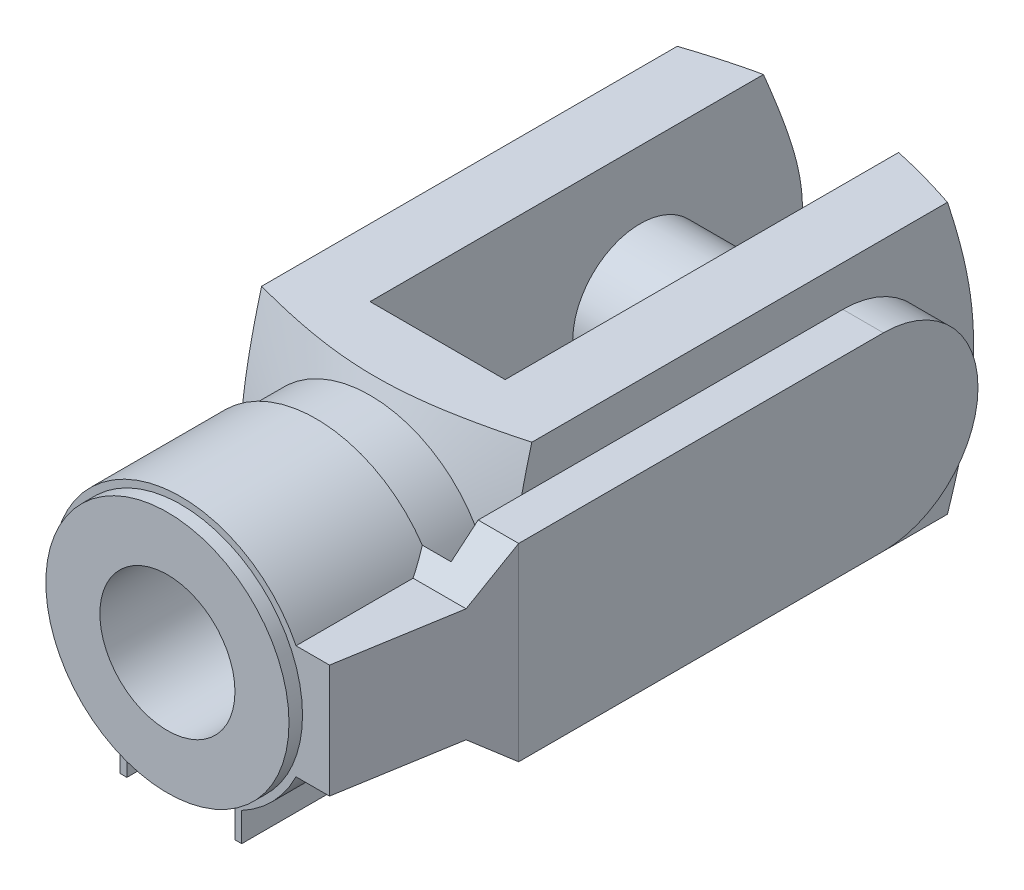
ISO-10303-21;
HEADER;
FILE_DESCRIPTION(('STEP AP214'),'2;1');
FILE_NAME('part.step','',(''),(''),'','','');
FILE_SCHEMA(('AUTOMOTIVE_DESIGN { 1 0 10303 214 1 1 1 1 }'));
ENDSEC;
DATA;
#1=APPLICATION_CONTEXT('core data for automotive mechanical design processes');
#2=APPLICATION_PROTOCOL_DEFINITION('international standard','automotive_design',2000,#1);
#3=PRODUCT_CONTEXT('',#1,'mechanical');
#4=PRODUCT('Part','Part','',(#3));
#5=PRODUCT_RELATED_PRODUCT_CATEGORY('part','',(#4));
#6=PRODUCT_DEFINITION_FORMATION('','',#4);
#7=PRODUCT_DEFINITION_CONTEXT('part definition',#1,'design');
#8=PRODUCT_DEFINITION('design','',#6,#7);
#9=PRODUCT_DEFINITION_SHAPE('','',#8);
#10=(LENGTH_UNIT() NAMED_UNIT(*) SI_UNIT(.MILLI.,.METRE.));
#11=(NAMED_UNIT(*) PLANE_ANGLE_UNIT() SI_UNIT($,.RADIAN.));
#12=(NAMED_UNIT(*) SI_UNIT($,.STERADIAN.) SOLID_ANGLE_UNIT());
#13=UNCERTAINTY_MEASURE_WITH_UNIT(LENGTH_MEASURE(1.E-05),#10,'distance_accuracy_value','');
#14=(GEOMETRIC_REPRESENTATION_CONTEXT(3) GLOBAL_UNCERTAINTY_ASSIGNED_CONTEXT((#13)) GLOBAL_UNIT_ASSIGNED_CONTEXT((#10,
#11,#12)) REPRESENTATION_CONTEXT('',''));
#15=CARTESIAN_POINT('',(0.,0.,0.));
#16=DIRECTION('',(0.,0.,1.));
#17=DIRECTION('',(1.,0.,0.));
#18=AXIS2_PLACEMENT_3D('',#15,#16,#17);
#19=CARTESIAN_POINT('',(13.0000000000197,7.00000000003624,26.9999999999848));
#20=DIRECTION('',(2.80773668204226E-12,1.,-2.17430240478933E-12));
#21=DIRECTION('',(1.,-2.80773668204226E-12,0.));
#22=AXIS2_PLACEMENT_3D('',#19,#20,#21);
#23=PLANE('',#22);
#24=DIRECTION('',(0.,-2.17430240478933E-12,-1.));
#25=VECTOR('',#24,1.);
#26=CARTESIAN_POINT('',(13.0000000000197,7.00000000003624,26.9999999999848));
#27=LINE('',#26,#25);
#28=CARTESIAN_POINT('',(13.0000000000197,6.99999999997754,-1.52031165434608E-11));
#29=VERTEX_POINT('',#28);
#30=CARTESIAN_POINT('',(13.0000000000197,7.00000000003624,26.9999999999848));
#31=VERTEX_POINT('',#30);
#32=EDGE_CURVE('E187',#29,#31,#27,.F.);
#33=ORIENTED_EDGE('',*,*,#32,.F.);
#34=DIRECTION('',(1.,-2.80773668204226E-12,0.));
#35=VECTOR('',#34,1.);
#36=CARTESIAN_POINT('',(13.0000000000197,6.99999999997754,-1.52031165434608E-11));
#37=LINE('',#36,#35);
#38=CARTESIAN_POINT('',(10.0000000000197,6.99999999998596,-1.52031165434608E-11));
#39=VERTEX_POINT('',#38);
#40=EDGE_CURVE('E196',#29,#39,#37,.F.);
#41=ORIENTED_EDGE('',*,*,#40,.T.);
#42=DIRECTION('',(0.,-2.17430240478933E-12,-1.));
#43=VECTOR('',#42,1.);
#44=CARTESIAN_POINT('',(10.0000000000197,6.99999999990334,-38.0000000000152));
#45=LINE('',#44,#43);
#46=CARTESIAN_POINT('',(10.0000000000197,7.00000000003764,23.7691186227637));
#47=VERTEX_POINT('',#46);
#48=EDGE_CURVE('E327',#47,#39,#45,.T.);
#49=ORIENTED_EDGE('',*,*,#48,.F.);
#50=DIRECTION('',(0.,-2.17430240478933E-12,-1.));
#51=VECTOR('',#50,1.);
#52=CARTESIAN_POINT('',(10.0000000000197,7.00000000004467,26.9999999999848));
#53=LINE('',#52,#51);
#54=CARTESIAN_POINT('',(10.0000000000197,7.00000000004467,26.9999999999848));
#55=VERTEX_POINT('',#54);
#56=EDGE_CURVE('E202',#47,#55,#53,.F.);
#57=ORIENTED_EDGE('',*,*,#56,.T.);
#58=DIRECTION('',(1.,-2.80773668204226E-12,0.));
#59=VECTOR('',#58,1.);
#60=CARTESIAN_POINT('',(13.0000000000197,7.00000000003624,26.9999999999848));
#61=LINE('',#60,#59);
#62=EDGE_CURVE('E199',#55,#31,#61,.T.);
#63=ORIENTED_EDGE('',*,*,#62,.T.);
#64=EDGE_LOOP('',(#33,#41,#49,#57,#63));
#65=FACE_BOUND('',#64,.T.);
#66=ADVANCED_FACE('F15',(#65),#23,.T.);
#67=CARTESIAN_POINT('',(12.9999999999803,-6.99999999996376,27.0000000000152));
#68=DIRECTION('',(1.,-2.80773668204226E-12,0.));
#69=DIRECTION('',(-2.80773668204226E-12,-1.,2.17430240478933E-12));
#70=AXIS2_PLACEMENT_3D('',#67,#68,#69);
#71=PLANE('',#70);
#72=CARTESIAN_POINT('',(13.,-2.24618934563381E-11,0.));
#73=DIRECTION('',(-1.,2.80773668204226E-12,0.));
#74=DIRECTION('',(2.80773668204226E-12,1.,-2.17430240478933E-12));
#75=AXIS2_PLACEMENT_3D('',#72,#73,#74);
#76=CIRCLE('',#75,7.);
#77=CARTESIAN_POINT('',(12.9999999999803,-7.00000000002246,1.52031165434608E-11));
#78=VERTEX_POINT('',#77);
#79=EDGE_CURVE('E191',#78,#29,#76,.F.);
#80=ORIENTED_EDGE('',*,*,#79,.T.);
#81=ORIENTED_EDGE('',*,*,#32,.T.);
#82=DIRECTION('',(-2.80773668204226E-12,-1.,2.17430240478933E-12));
#83=VECTOR('',#82,1.);
#84=CARTESIAN_POINT('',(12.9999999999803,-6.99999999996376,27.0000000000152));
#85=LINE('',#84,#83);
#86=CARTESIAN_POINT('',(12.9999999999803,-6.99999999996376,27.0000000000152));
#87=VERTEX_POINT('',#86);
#88=EDGE_CURVE('E195',#31,#87,#85,.T.);
#89=ORIENTED_EDGE('',*,*,#88,.T.);
#90=DIRECTION('',(0.,-2.17430240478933E-12,-1.));
#91=VECTOR('',#90,1.);
#92=CARTESIAN_POINT('',(12.9999999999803,-6.99999999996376,27.0000000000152));
#93=LINE('',#92,#91);
#94=EDGE_CURVE('E192',#87,#78,#93,.T.);
#95=ORIENTED_EDGE('',*,*,#94,.T.);
#96=EDGE_LOOP('',(#80,#81,#89,#95));
#97=FACE_BOUND('',#96,.T.);
#98=ADVANCED_FACE('F315',(#97),#71,.T.);
#99=CARTESIAN_POINT('',(11.5,-1.82502884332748E-11,0.));
#100=DIRECTION('',(-1.,2.80773668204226E-12,0.));
#101=DIRECTION('',(2.80773668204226E-12,1.,-2.17430240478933E-12));
#102=AXIS2_PLACEMENT_3D('',#99,#100,#101);
#103=CYLINDRICAL_SURFACE('',#102,7.);
#104=DIRECTION('',(-1.,2.80773668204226E-12,0.));
#105=VECTOR('',#104,1.);
#106=CARTESIAN_POINT('',(11.4999999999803,-7.00000000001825,1.52031165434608E-11));
#107=LINE('',#106,#105);
#108=CARTESIAN_POINT('',(9.99999999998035,-7.00000000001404,1.52031165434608E-11));
#109=VERTEX_POINT('',#108);
#110=EDGE_CURVE('E205',#78,#109,#107,.T.);
#111=ORIENTED_EDGE('',*,*,#110,.T.);
#112=CARTESIAN_POINT('',(10.,-1.40386834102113E-11,0.));
#113=DIRECTION('',(-1.,2.80773668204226E-12,0.));
#114=DIRECTION('',(0.,2.17430240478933E-12,1.));
#115=AXIS2_PLACEMENT_3D('',#112,#113,#114);
#116=CIRCLE('',#115,7.);
#117=EDGE_CURVE('E324',#39,#109,#116,.T.);
#118=ORIENTED_EDGE('',*,*,#117,.F.);
#119=ORIENTED_EDGE('',*,*,#40,.F.);
#120=ORIENTED_EDGE('',*,*,#79,.F.);
#121=EDGE_LOOP('',(#111,#118,#119,#120));
#122=FACE_BOUND('',#121,.T.);
#123=ADVANCED_FACE('F319',(#122),#103,.T.);
#124=CARTESIAN_POINT('',(10.0000000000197,7.00000000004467,26.9999999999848));
#125=DIRECTION('',(-1.,2.80773668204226E-12,0.));
#126=DIRECTION('',(2.80773668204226E-12,1.,-2.17430240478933E-12));
#127=AXIS2_PLACEMENT_3D('',#124,#125,#126);
#128=PLANE('',#127);
#129=CARTESIAN_POINT('',(9.99999999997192,-9.99999999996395,23.026119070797));
#130=CARTESIAN_POINT('',(9.99999999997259,-9.76124311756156,23.0909210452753));
#131=CARTESIAN_POINT('',(9.99999999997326,-9.52219552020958,23.1546510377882));
#132=CARTESIAN_POINT('',(9.99999999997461,-9.0434549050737,23.2796791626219));
#133=CARTESIAN_POINT('',(9.99999999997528,-8.80376186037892,23.3409771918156));
#134=CARTESIAN_POINT('',(9.99999999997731,-8.08339828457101,23.5208459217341));
#135=CARTESIAN_POINT('',(9.99999999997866,-7.60169252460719,23.6353229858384));
#136=CARTESIAN_POINT('',(9.99999999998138,-6.63262542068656,23.8510454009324));
#137=CARTESIAN_POINT('',(9.99999999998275,-6.14524763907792,23.9522175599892));
#138=CARTESIAN_POINT('',(9.99999999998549,-5.16720650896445,24.1370481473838));
#139=CARTESIAN_POINT('',(9.99999999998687,-4.67654363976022,24.2207090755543));
#140=CARTESIAN_POINT('',(9.9999999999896,-3.70570081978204,24.3645517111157));
#141=CARTESIAN_POINT('',(9.99999999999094,-3.225609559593,24.4253225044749));
#142=CARTESIAN_POINT('',(9.99999999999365,-2.26297611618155,24.5231031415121));
#143=CARTESIAN_POINT('',(9.999999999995,-1.78043400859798,24.560113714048));
#144=CARTESIAN_POINT('',(9.99999999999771,-0.815299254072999,24.607767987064));
#145=CARTESIAN_POINT('',(9.99999999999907,-0.332710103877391,24.6184810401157));
#146=CARTESIAN_POINT('',(10.0000000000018,0.632303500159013,24.612929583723));
#147=CARTESIAN_POINT('',(10.0000000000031,1.11472795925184,24.5966660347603));
#148=CARTESIAN_POINT('',(10.0000000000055,1.94841292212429,24.5462368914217));
#149=CARTESIAN_POINT('',(10.0000000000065,2.30005451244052,24.5180624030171));
#150=CARTESIAN_POINT('',(10.0000000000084,3.00206554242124,24.4490058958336));
#151=CARTESIAN_POINT('',(10.0000000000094,3.35243504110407,24.4081244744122));
#152=CARTESIAN_POINT('',(10.0000000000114,4.05223869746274,24.314865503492));
#153=CARTESIAN_POINT('',(10.0000000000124,4.40167020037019,24.2624682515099));
#154=CARTESIAN_POINT('',(10.0000000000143,5.09887023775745,24.1476353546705));
#155=CARTESIAN_POINT('',(10.0000000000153,5.4466387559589,24.0851996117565));
#156=CARTESIAN_POINT('',(10.0000000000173,6.14794582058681,23.9502471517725));
#157=CARTESIAN_POINT('',(10.0000000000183,6.50144803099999,23.8775428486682));
#158=CARTESIAN_POINT('',(10.0000000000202,7.20679295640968,23.7244675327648));
#159=CARTESIAN_POINT('',(10.0000000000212,7.55863561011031,23.644096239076));
#160=CARTESIAN_POINT('',(10.0000000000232,8.25955356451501,23.4771861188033));
#161=CARTESIAN_POINT('',(10.0000000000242,8.60863423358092,23.390669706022));
#162=CARTESIAN_POINT('',(10.0000000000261,9.30535013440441,23.2122169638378));
#163=CARTESIAN_POINT('',(10.0000000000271,9.65298559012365,23.1202815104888));
#164=CARTESIAN_POINT('',(10.0000000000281,10.000000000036,23.0261190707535));
#165=B_SPLINE_CURVE_WITH_KNOTS('',3,(#129,#130,#131,#132,#133,#134,#135,#136,#137,#138,#139,
#140,#141,#142,#143,#144,#145,#146,#147,#148,#149,#150,#151,#152,#153,#154,#155,#156,#157,#158,
#159,#160,#161,#162,#163,#164),.UNSPECIFIED.,.F.,.F.,(4,2,2,2,2,2,2,2,2,2,2,2,2,2,2,2,2,4),(0.,
0.74217954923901,1.48439053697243,2.96958754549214,4.46264048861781,5.95548014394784,
7.40673795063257,8.85795123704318,10.3053332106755,11.752663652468,12.810737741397,
13.8687620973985,14.9286109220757,15.9884701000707,17.07107413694,18.1537178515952,
19.2325975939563,20.311303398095),.UNSPECIFIED.);
#166=CARTESIAN_POINT('',(9.99999999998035,-6.99999999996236,23.7691186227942));
#167=VERTEX_POINT('',#166);
#168=EDGE_CURVE('E604',#167,#47,#165,.T.);
#169=ORIENTED_EDGE('',*,*,#168,.F.);
#170=DIRECTION('',(0.,-2.17430240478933E-12,-1.));
#171=VECTOR('',#170,1.);
#172=CARTESIAN_POINT('',(9.99999999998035,-6.99999999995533,27.0000000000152));
#173=LINE('',#172,#171);
#174=CARTESIAN_POINT('',(9.99999999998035,-6.99999999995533,27.0000000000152));
#175=VERTEX_POINT('',#174);
#176=EDGE_CURVE('E211',#175,#167,#173,.T.);
#177=ORIENTED_EDGE('',*,*,#176,.F.);
#178=DIRECTION('',(1.80477835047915E-12,0.642787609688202,0.766044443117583));
#179=VECTOR('',#178,1.);
#180=CARTESIAN_POINT('',(9.99999999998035,-6.99999999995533,27.0000000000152));
#181=LINE('',#180,#179);
#182=CARTESIAN_POINT('',(9.99999999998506,-5.32180073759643,29.0000000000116));
#183=VERTEX_POINT('',#182);
#184=EDGE_CURVE('E231',#175,#183,#181,.T.);
#185=ORIENTED_EDGE('',*,*,#184,.T.);
#186=DIRECTION('',(2.80773668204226E-12,1.,-2.17430240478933E-12));
#187=VECTOR('',#186,1.);
#188=CARTESIAN_POINT('',(10.0000000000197,7.00000000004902,28.9999999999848));
#189=LINE('',#188,#187);
#190=CARTESIAN_POINT('',(10.0000000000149,5.32180073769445,28.9999999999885));
#191=VERTEX_POINT('',#190);
#192=EDGE_CURVE('E146',#183,#191,#189,.T.);
#193=ORIENTED_EDGE('',*,*,#192,.T.);
#194=DIRECTION('',(1.80477835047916E-12,0.642787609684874,-0.766044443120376));
#195=VECTOR('',#194,1.);
#196=CARTESIAN_POINT('',(10.0000000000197,7.00000000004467,26.9999999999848));
#197=LINE('',#196,#195);
#198=EDGE_CURVE('E226',#55,#191,#197,.F.);
#199=ORIENTED_EDGE('',*,*,#198,.F.);
#200=ORIENTED_EDGE('',*,*,#56,.F.);
#201=EDGE_LOOP('',(#169,#177,#185,#193,#199,#200));
#202=FACE_BOUND('',#201,.T.);
#203=ADVANCED_FACE('F605',(#202),#128,.T.);
#204=CARTESIAN_POINT('',(13.0000000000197,7.00000000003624,26.9999999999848));
#205=DIRECTION('',(2.15085108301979E-12,0.766044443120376,0.642787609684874));
#206=DIRECTION('',(1.80477835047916E-12,0.642787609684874,-0.766044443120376));
#207=AXIS2_PLACEMENT_3D('',#204,#205,#206);
#208=PLANE('',#207);
#209=DIRECTION('',(0.126646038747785,0.637611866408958,-0.759876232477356));
#210=VECTOR('',#209,1.);
#211=CARTESIAN_POINT('',(12.4438483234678,4.20000000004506,30.3369100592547));
#212=LINE('',#211,#210);
#213=CARTESIAN_POINT('',(12.4438483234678,4.20000000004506,30.3369100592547));
#214=VERTEX_POINT('',#213);
#215=EDGE_CURVE('E212',#214,#31,#212,.T.);
#216=ORIENTED_EDGE('',*,*,#215,.T.);
#217=ORIENTED_EDGE('',*,*,#62,.F.);
#218=ORIENTED_EDGE('',*,*,#198,.T.);
#219=DIRECTION('',(-1.,2.80773668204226E-12,0.));
#220=VECTOR('',#219,1.);
#221=CARTESIAN_POINT('',(13.0000000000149,5.32180073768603,28.9999999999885));
#222=LINE('',#221,#220);
#223=CARTESIAN_POINT('',(7.86946230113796,5.32180073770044,28.9999999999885));
#224=VERTEX_POINT('',#223);
#225=EDGE_CURVE('E223',#191,#224,#222,.T.);
#226=ORIENTED_EDGE('',*,*,#225,.T.);
#227=CARTESIAN_POINT('',(0.,9.08834772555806E-11,35.3422751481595));
#228=DIRECTION('',(2.15085108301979E-12,0.766044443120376,0.642787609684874));
#229=DIRECTION('',(1.80477835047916E-12,0.642787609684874,-0.766044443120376));
#230=AXIS2_PLACEMENT_3D('',#227,#228,#229);
#231=ELLIPSE('',#230,14.7793763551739,9.5);
#232=CARTESIAN_POINT('',(8.52115015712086,4.20000000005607,30.3369100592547));
#233=VERTEX_POINT('',#232);
#234=EDGE_CURVE('E222',#224,#233,#231,.F.);
#235=ORIENTED_EDGE('',*,*,#234,.T.);
#236=DIRECTION('',(-1.,2.80773668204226E-12,0.));
#237=VECTOR('',#236,1.);
#238=CARTESIAN_POINT('',(13.0000000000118,4.2000000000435,30.3369100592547));
#239=LINE('',#238,#237);
#240=EDGE_CURVE('E218',#233,#214,#239,.F.);
#241=ORIENTED_EDGE('',*,*,#240,.T.);
#242=EDGE_LOOP('',(#216,#217,#218,#226,#235,#241));
#243=FACE_BOUND('',#242,.T.);
#244=ADVANCED_FACE('F292',(#243),#208,.T.);
#245=CARTESIAN_POINT('',(9.99999999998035,-6.99999999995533,27.0000000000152));
#246=DIRECTION('',(-2.80773668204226E-12,-1.,2.17430240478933E-12));
#247=DIRECTION('',(-1.,2.80773668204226E-12,0.));
#248=AXIS2_PLACEMENT_3D('',#245,#246,#247);
#249=PLANE('',#248);
#250=ORIENTED_EDGE('',*,*,#94,.F.);
#251=DIRECTION('',(-1.,2.80773668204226E-12,0.));
#252=VECTOR('',#251,1.);
#253=CARTESIAN_POINT('',(9.99999999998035,-6.99999999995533,27.0000000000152));
#254=LINE('',#253,#252);
#255=EDGE_CURVE('E208',#87,#175,#254,.T.);
#256=ORIENTED_EDGE('',*,*,#255,.T.);
#257=ORIENTED_EDGE('',*,*,#176,.T.);
#258=DIRECTION('',(0.,2.17430240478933E-12,1.));
#259=VECTOR('',#258,1.);
#260=CARTESIAN_POINT('',(9.99999999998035,-7.00000000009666,-37.9999999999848));
#261=LINE('',#260,#259);
#262=EDGE_CURVE('E183',#109,#167,#261,.T.);
#263=ORIENTED_EDGE('',*,*,#262,.F.);
#264=ORIENTED_EDGE('',*,*,#110,.F.);
#265=EDGE_LOOP('',(#250,#256,#257,#263,#264));
#266=FACE_BOUND('',#265,.T.);
#267=ADVANCED_FACE('F357',(#266),#249,.T.);
#268=CARTESIAN_POINT('',(12.9999999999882,-4.1999999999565,30.3369100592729));
#269=DIRECTION('',(-2.15085108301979E-12,-0.766044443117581,0.642787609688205));
#270=DIRECTION('',(1.80477835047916E-12,0.642787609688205,0.766044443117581));
#271=AXIS2_PLACEMENT_3D('',#268,#269,#270);
#272=PLANE('',#271);
#273=CARTESIAN_POINT('',(0.,9.08834772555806E-11,35.3422751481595));
#274=DIRECTION('',(-2.15085108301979E-12,-0.766044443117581,0.642787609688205));
#275=DIRECTION('',(-1.80477835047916E-12,-0.642787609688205,-0.766044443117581));
#276=AXIS2_PLACEMENT_3D('',#273,#274,#275);
#277=ELLIPSE('',#276,14.7793763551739,9.5);
#278=CARTESIAN_POINT('',(8.52115015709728,-4.19999999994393,30.3369100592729));
#279=VERTEX_POINT('',#278);
#280=CARTESIAN_POINT('',(7.86946230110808,-5.32180073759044,29.0000000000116));
#281=VERTEX_POINT('',#280);
#282=EDGE_CURVE('E133',#279,#281,#277,.F.);
#283=ORIENTED_EDGE('',*,*,#282,.T.);
#284=DIRECTION('',(-1.,2.80773668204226E-12,0.));
#285=VECTOR('',#284,1.);
#286=CARTESIAN_POINT('',(12.9999999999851,-5.32180073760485,29.0000000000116));
#287=LINE('',#286,#285);
#288=EDGE_CURVE('E143',#281,#183,#287,.F.);
#289=ORIENTED_EDGE('',*,*,#288,.T.);
#290=ORIENTED_EDGE('',*,*,#184,.F.);
#291=ORIENTED_EDGE('',*,*,#255,.F.);
#292=DIRECTION('',(-0.126646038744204,0.637611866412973,0.759876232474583));
#293=VECTOR('',#292,1.);
#294=CARTESIAN_POINT('',(12.9999999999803,-6.99999999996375,27.0000000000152));
#295=LINE('',#294,#293);
#296=CARTESIAN_POINT('',(12.4438483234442,-4.19999999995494,30.3369100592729));
#297=VERTEX_POINT('',#296);
#298=EDGE_CURVE('E215',#87,#297,#295,.T.);
#299=ORIENTED_EDGE('',*,*,#298,.T.);
#300=DIRECTION('',(-1.,2.80773668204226E-12,0.));
#301=VECTOR('',#300,1.);
#302=CARTESIAN_POINT('',(12.9999999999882,-4.1999999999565,30.3369100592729));
#303=LINE('',#302,#301);
#304=EDGE_CURVE('E153',#297,#279,#303,.T.);
#305=ORIENTED_EDGE('',*,*,#304,.T.);
#306=EDGE_LOOP('',(#283,#289,#290,#291,#299,#305));
#307=FACE_BOUND('',#306,.T.);
#308=ADVANCED_FACE('F151',(#307),#272,.T.);
#309=CARTESIAN_POINT('',(0.,7.70934531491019E-11,29.));
#310=DIRECTION('',(0.,-2.17430240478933E-12,-1.));
#311=DIRECTION('',(-1.,2.80773668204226E-12,0.));
#312=AXIS2_PLACEMENT_3D('',#309,#310,#311);
#313=PLANE('',#312);
#314=ORIENTED_EDGE('',*,*,#192,.F.);
#315=ORIENTED_EDGE('',*,*,#288,.F.);
#316=CARTESIAN_POINT('',(0.,7.70934531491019E-11,29.));
#317=DIRECTION('',(0.,-2.17430240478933E-12,-1.));
#318=DIRECTION('',(-1.,2.80773668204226E-12,0.));
#319=AXIS2_PLACEMENT_3D('',#316,#317,#318);
#320=CIRCLE('',#319,9.5);
#321=CARTESIAN_POINT('',(4.49999999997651,-8.3666002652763,29.0000000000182));
#322=VERTEX_POINT('',#321);
#323=EDGE_CURVE('E129',#281,#322,#320,.T.);
#324=ORIENTED_EDGE('',*,*,#323,.T.);
#325=DIRECTION('',(2.80773668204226E-12,1.,-2.17430240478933E-12));
#326=VECTOR('',#325,1.);
#327=CARTESIAN_POINT('',(4.5,6.44586380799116E-11,29.));
#328=LINE('',#327,#326);
#329=CARTESIAN_POINT('',(4.49999999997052,-10.4999999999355,29.0000000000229));
#330=VERTEX_POINT('',#329);
#331=EDGE_CURVE('E140',#322,#330,#328,.F.);
#332=ORIENTED_EDGE('',*,*,#331,.T.);
#333=DIRECTION('',(-1.,2.80773668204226E-12,0.));
#334=VECTOR('',#333,1.);
#335=CARTESIAN_POINT('',(4.49999999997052,-10.4999999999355,29.0000000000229));
#336=LINE('',#335,#334);
#337=CARTESIAN_POINT('',(3.99999999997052,-10.4999999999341,29.0000000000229));
#338=VERTEX_POINT('',#337);
#339=EDGE_CURVE('E280',#338,#330,#336,.F.);
#340=ORIENTED_EDGE('',*,*,#339,.F.);
#341=DIRECTION('',(2.80773668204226E-12,1.,-2.17430240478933E-12));
#342=VECTOR('',#341,1.);
#343=CARTESIAN_POINT('',(4.,6.58625064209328E-11,29.));
#344=LINE('',#343,#342);
#345=CARTESIAN_POINT('',(3.99999999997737,-8.06225774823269,29.0000000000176));
#346=VERTEX_POINT('',#345);
#347=EDGE_CURVE('E257',#338,#346,#344,.T.);
#348=ORIENTED_EDGE('',*,*,#347,.T.);
#349=CARTESIAN_POINT('',(0.,7.70934531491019E-11,29.));
#350=DIRECTION('',(0.,-2.17430240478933E-12,-1.));
#351=DIRECTION('',(-1.,2.80773668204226E-12,0.));
#352=AXIS2_PLACEMENT_3D('',#349,#350,#351);
#353=CIRCLE('',#352,9.);
#354=CARTESIAN_POINT('',(-4.00000000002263,-8.06225774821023,29.0000000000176));
#355=VERTEX_POINT('',#354);
#356=EDGE_CURVE('E25',#346,#355,#353,.F.);
#357=ORIENTED_EDGE('',*,*,#356,.T.);
#358=DIRECTION('',(2.80773668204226E-12,1.,-2.17430240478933E-12));
#359=VECTOR('',#358,1.);
#360=CARTESIAN_POINT('',(-4.,8.83243998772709E-11,29.));
#361=LINE('',#360,#359);
#362=CARTESIAN_POINT('',(-4.00000000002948,-10.4999999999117,29.0000000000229));
#363=VERTEX_POINT('',#362);
#364=EDGE_CURVE('E255',#355,#363,#361,.F.);
#365=ORIENTED_EDGE('',*,*,#364,.T.);
#366=DIRECTION('',(-1.,2.80773668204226E-12,0.));
#367=VECTOR('',#366,1.);
#368=CARTESIAN_POINT('',(-4.00000000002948,-10.4999999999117,29.0000000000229));
#369=LINE('',#368,#367);
#370=CARTESIAN_POINT('',(-4.50000000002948,-10.4999999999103,29.0000000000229));
#371=VERTEX_POINT('',#370);
#372=EDGE_CURVE('E284',#371,#363,#369,.F.);
#373=ORIENTED_EDGE('',*,*,#372,.F.);
#374=DIRECTION('',(2.80773668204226E-12,1.,-2.17430240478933E-12));
#375=VECTOR('',#374,1.);
#376=CARTESIAN_POINT('',(-4.5,8.9728268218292E-11,29.));
#377=LINE('',#376,#375);
#378=CARTESIAN_POINT('',(-4.50000000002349,-8.36660026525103,29.0000000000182));
#379=VERTEX_POINT('',#378);
#380=EDGE_CURVE('E170',#371,#379,#377,.T.);
#381=ORIENTED_EDGE('',*,*,#380,.T.);
#382=CARTESIAN_POINT('',(0.,7.70934531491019E-11,29.));
#383=DIRECTION('',(0.,-2.17430240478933E-12,-1.));
#384=DIRECTION('',(-1.,2.80773668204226E-12,0.));
#385=AXIS2_PLACEMENT_3D('',#382,#383,#384);
#386=CIRCLE('',#385,9.5);
#387=EDGE_CURVE('E167',#224,#379,#386,.F.);
#388=ORIENTED_EDGE('',*,*,#387,.F.);
#389=ORIENTED_EDGE('',*,*,#225,.F.);
#390=EDGE_LOOP('',(#314,#315,#324,#332,#340,#348,#357,#365,#373,#381,#388,#389));
#391=FACE_BOUND('',#390,.T.);
#392=ADVANCED_FACE('F144',(#391),#313,.T.);
#393=CARTESIAN_POINT('',(0.,9.88364771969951E-11,39.));
#394=DIRECTION('',(0.,-2.17430240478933E-12,-1.));
#395=DIRECTION('',(-1.,2.80773668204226E-12,0.));
#396=AXIS2_PLACEMENT_3D('',#393,#394,#395);
#397=PLANE('',#396);
#398=DIRECTION('',(2.80773668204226E-12,1.,-2.17430240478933E-12));
#399=VECTOR('',#398,1.);
#400=CARTESIAN_POINT('',(4.,8.76055304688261E-11,39.));
#401=LINE('',#400,#399);
#402=CARTESIAN_POINT('',(3.99999999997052,-10.4999999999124,39.0000000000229));
#403=VERTEX_POINT('',#402);
#404=CARTESIAN_POINT('',(3.99999999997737,-8.06225774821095,39.0000000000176));
#405=VERTEX_POINT('',#404);
#406=EDGE_CURVE('E239',#403,#405,#401,.T.);
#407=ORIENTED_EDGE('',*,*,#406,.F.);
#408=DIRECTION('',(-1.,2.80773668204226E-12,0.));
#409=VECTOR('',#408,1.);
#410=CARTESIAN_POINT('',(4.49999999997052,-10.4999999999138,39.0000000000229));
#411=LINE('',#410,#409);
#412=CARTESIAN_POINT('',(4.49999999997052,-10.4999999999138,39.0000000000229));
#413=VERTEX_POINT('',#412);
#414=EDGE_CURVE('E282',#413,#403,#411,.T.);
#415=ORIENTED_EDGE('',*,*,#414,.F.);
#416=DIRECTION('',(2.80773668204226E-12,1.,-2.17430240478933E-12));
#417=VECTOR('',#416,1.);
#418=CARTESIAN_POINT('',(4.5,8.62016621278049E-11,39.));
#419=LINE('',#418,#417);
#420=CARTESIAN_POINT('',(4.49999999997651,-8.36660026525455,39.0000000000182));
#421=VERTEX_POINT('',#420);
#422=EDGE_CURVE('E162',#421,#413,#419,.F.);
#423=ORIENTED_EDGE('',*,*,#422,.F.);
#424=CARTESIAN_POINT('',(0.,9.88364771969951E-11,39.));
#425=DIRECTION('',(0.,-2.17430240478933E-12,-1.));
#426=DIRECTION('',(-1.,2.80773668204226E-12,0.));
#427=AXIS2_PLACEMENT_3D('',#424,#425,#426);
#428=CIRCLE('',#427,9.5);
#429=CARTESIAN_POINT('',(8.52115015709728,-4.19999999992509,39.0000000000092));
#430=VERTEX_POINT('',#429);
#431=EDGE_CURVE('E160',#430,#421,#428,.T.);
#432=ORIENTED_EDGE('',*,*,#431,.F.);
#433=DIRECTION('',(-1.,2.80773668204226E-12,0.));
#434=VECTOR('',#433,1.);
#435=CARTESIAN_POINT('',(-1.17924940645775E-11,-4.19999999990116,39.0000000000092));
#436=LINE('',#435,#434);
#437=CARTESIAN_POINT('',(10.9999999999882,-4.19999999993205,39.0000000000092));
#438=VERTEX_POINT('',#437);
#439=EDGE_CURVE('E163',#438,#430,#436,.T.);
#440=ORIENTED_EDGE('',*,*,#439,.F.);
#441=DIRECTION('',(2.80773668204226E-12,1.,-2.17430240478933E-12));
#442=VECTOR('',#441,1.);
#443=CARTESIAN_POINT('',(11.0000000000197,7.00000000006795,38.9999999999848));
#444=LINE('',#443,#442);
#445=CARTESIAN_POINT('',(11.0000000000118,4.20000000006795,38.9999999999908));
#446=VERTEX_POINT('',#445);
#447=EDGE_CURVE('E234',#438,#446,#444,.T.);
#448=ORIENTED_EDGE('',*,*,#447,.T.);
#449=DIRECTION('',(1.,-2.80773668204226E-12,0.));
#450=VECTOR('',#449,1.);
#451=CARTESIAN_POINT('',(13.0000000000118,4.20000000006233,38.9999999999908));
#452=LINE('',#451,#450);
#453=CARTESIAN_POINT('',(8.52115015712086,4.20000000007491,38.9999999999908));
#454=VERTEX_POINT('',#453);
#455=EDGE_CURVE('E155',#454,#446,#452,.T.);
#456=ORIENTED_EDGE('',*,*,#455,.F.);
#457=CARTESIAN_POINT('',(0.,9.88364771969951E-11,39.));
#458=DIRECTION('',(0.,-2.17430240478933E-12,-1.));
#459=DIRECTION('',(-1.,2.80773668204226E-12,0.));
#460=AXIS2_PLACEMENT_3D('',#457,#458,#459);
#461=CIRCLE('',#460,9.5);
#462=CARTESIAN_POINT('',(-4.50000000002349,-8.36660026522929,39.0000000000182));
#463=VERTEX_POINT('',#462);
#464=EDGE_CURVE('E164',#463,#454,#461,.T.);
#465=ORIENTED_EDGE('',*,*,#464,.F.);
#466=DIRECTION('',(2.80773668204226E-12,1.,-2.17430240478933E-12));
#467=VECTOR('',#466,1.);
#468=CARTESIAN_POINT('',(-4.5,1.11471292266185E-10,39.));
#469=LINE('',#468,#467);
#470=CARTESIAN_POINT('',(-4.50000000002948,-10.4999999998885,39.0000000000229));
#471=VERTEX_POINT('',#470);
#472=EDGE_CURVE('E166',#471,#463,#469,.T.);
#473=ORIENTED_EDGE('',*,*,#472,.F.);
#474=DIRECTION('',(-1.,2.80773668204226E-12,0.));
#475=VECTOR('',#474,1.);
#476=CARTESIAN_POINT('',(-4.00000000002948,-10.4999999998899,39.0000000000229));
#477=LINE('',#476,#475);
#478=CARTESIAN_POINT('',(-4.00000000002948,-10.4999999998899,39.0000000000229));
#479=VERTEX_POINT('',#478);
#480=EDGE_CURVE('E286',#479,#471,#477,.T.);
#481=ORIENTED_EDGE('',*,*,#480,.F.);
#482=DIRECTION('',(2.80773668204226E-12,1.,-2.17430240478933E-12));
#483=VECTOR('',#482,1.);
#484=CARTESIAN_POINT('',(-4.,1.10067423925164E-10,39.));
#485=LINE('',#484,#483);
#486=CARTESIAN_POINT('',(-4.00000000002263,-8.06225774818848,39.0000000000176));
#487=VERTEX_POINT('',#486);
#488=EDGE_CURVE('E248',#487,#479,#485,.F.);
#489=ORIENTED_EDGE('',*,*,#488,.F.);
#490=CARTESIAN_POINT('',(0.,9.88359261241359E-11,39.));
#491=DIRECTION('',(0.,-2.17430240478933E-12,-1.));
#492=DIRECTION('',(-2.80773668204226E-12,-1.,2.17430240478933E-12));
#493=AXIS2_PLACEMENT_3D('',#490,#491,#492);
#494=CIRCLE('',#493,9.);
#495=EDGE_CURVE('E176',#405,#487,#494,.F.);
#496=ORIENTED_EDGE('',*,*,#495,.F.);
#497=EDGE_LOOP('',(#407,#415,#423,#432,#440,#448,#456,#465,#473,#481,#489,#496));
#498=FACE_BOUND('',#497,.T.);
#499=ADVANCED_FACE('F341',(#498),#397,.F.);
#500=CARTESIAN_POINT('',(3.99999999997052,-10.4999999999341,29.0000000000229));
#501=DIRECTION('',(-1.,2.80773668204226E-12,0.));
#502=DIRECTION('',(2.80773668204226E-12,1.,-2.17430240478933E-12));
#503=AXIS2_PLACEMENT_3D('',#500,#501,#502);
#504=PLANE('',#503);
#505=ORIENTED_EDGE('',*,*,#347,.F.);
#506=DIRECTION('',(0.,-2.17430240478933E-12,-1.));
#507=VECTOR('',#506,1.);
#508=CARTESIAN_POINT('',(3.99999999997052,-10.4999999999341,29.0000000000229));
#509=LINE('',#508,#507);
#510=EDGE_CURVE('E262',#338,#403,#509,.F.);
#511=ORIENTED_EDGE('',*,*,#510,.T.);
#512=ORIENTED_EDGE('',*,*,#406,.T.);
#513=DIRECTION('',(0.,-2.17430240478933E-12,-1.));
#514=VECTOR('',#513,1.);
#515=CARTESIAN_POINT('',(3.99999999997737,-8.06225774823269,29.0000000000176));
#516=LINE('',#515,#514);
#517=EDGE_CURVE('E9',#405,#346,#516,.T.);
#518=ORIENTED_EDGE('',*,*,#517,.T.);
#519=EDGE_LOOP('',(#505,#511,#512,#518));
#520=FACE_BOUND('',#519,.T.);
#521=ADVANCED_FACE('F700',(#520),#504,.T.);
#522=CARTESIAN_POINT('',(4.49999999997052,-10.4999999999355,29.0000000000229));
#523=DIRECTION('',(-2.80773668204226E-12,-1.,2.17430240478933E-12));
#524=DIRECTION('',(-1.,2.80773668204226E-12,0.));
#525=AXIS2_PLACEMENT_3D('',#522,#523,#524);
#526=PLANE('',#525);
#527=ORIENTED_EDGE('',*,*,#339,.T.);
#528=DIRECTION('',(0.,-2.17430240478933E-12,-1.));
#529=VECTOR('',#528,1.);
#530=CARTESIAN_POINT('',(4.49999999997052,-10.4999999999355,29.0000000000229));
#531=LINE('',#530,#529);
#532=EDGE_CURVE('E265',#413,#330,#531,.T.);
#533=ORIENTED_EDGE('',*,*,#532,.F.);
#534=ORIENTED_EDGE('',*,*,#414,.T.);
#535=ORIENTED_EDGE('',*,*,#510,.F.);
#536=EDGE_LOOP('',(#527,#533,#534,#535));
#537=FACE_BOUND('',#536,.T.);
#538=ADVANCED_FACE('F697',(#537),#526,.T.);
#539=CARTESIAN_POINT('',(4.49999999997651,-8.36660026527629,29.0000000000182));
#540=DIRECTION('',(1.,-2.80773668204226E-12,0.));
#541=DIRECTION('',(-2.80773668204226E-12,-1.,2.17430240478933E-12));
#542=AXIS2_PLACEMENT_3D('',#539,#540,#541);
#543=PLANE('',#542);
#544=ORIENTED_EDGE('',*,*,#331,.F.);
#545=DIRECTION('',(0.,-2.17430240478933E-12,-1.));
#546=VECTOR('',#545,1.);
#547=CARTESIAN_POINT('',(4.49999999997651,-8.3666002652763,29.0000000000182));
#548=LINE('',#547,#546);
#549=EDGE_CURVE('E136',#421,#322,#548,.T.);
#550=ORIENTED_EDGE('',*,*,#549,.F.);
#551=ORIENTED_EDGE('',*,*,#422,.T.);
#552=ORIENTED_EDGE('',*,*,#532,.T.);
#553=EDGE_LOOP('',(#544,#550,#551,#552));
#554=FACE_BOUND('',#553,.T.);
#555=ADVANCED_FACE('F699',(#554),#543,.T.);
#556=CARTESIAN_POINT('',(0.,7.70934531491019E-11,29.));
#557=DIRECTION('',(0.,-2.17430240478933E-12,-1.));
#558=DIRECTION('',(-1.,2.80773668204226E-12,0.));
#559=AXIS2_PLACEMENT_3D('',#556,#557,#558);
#560=CYLINDRICAL_SURFACE('',#559,9.5);
#561=ORIENTED_EDGE('',*,*,#323,.F.);
#562=ORIENTED_EDGE('',*,*,#282,.F.);
#563=DIRECTION('',(0.,2.17419988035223E-12,1.));
#564=VECTOR('',#563,1.);
#565=CARTESIAN_POINT('',(8.52115015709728,-4.19999999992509,39.0000000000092));
#566=LINE('',#565,#564);
#567=EDGE_CURVE('E169',#430,#279,#566,.F.);
#568=ORIENTED_EDGE('',*,*,#567,.F.);
#569=ORIENTED_EDGE('',*,*,#431,.T.);
#570=ORIENTED_EDGE('',*,*,#549,.T.);
#571=EDGE_LOOP('',(#561,#562,#568,#569,#570));
#572=FACE_BOUND('',#571,.T.);
#573=ADVANCED_FACE('F131',(#572),#560,.T.);
#574=CARTESIAN_POINT('',(12.9999999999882,-4.19999999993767,39.0000000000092));
#575=DIRECTION('',(-2.80773668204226E-12,-1.,2.17419988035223E-12));
#576=DIRECTION('',(0.,2.17419988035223E-12,1.));
#577=AXIS2_PLACEMENT_3D('',#574,#575,#576);
#578=PLANE('',#577);
#579=ORIENTED_EDGE('',*,*,#567,.T.);
#580=ORIENTED_EDGE('',*,*,#304,.F.);
#581=DIRECTION('',(-0.164398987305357,2.60630774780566E-12,0.986393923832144));
#582=VECTOR('',#581,1.);
#583=CARTESIAN_POINT('',(12.9999999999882,-4.19999999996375,27.0000000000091));
#584=LINE('',#583,#582);
#585=EDGE_CURVE('E217',#297,#438,#584,.T.);
#586=ORIENTED_EDGE('',*,*,#585,.T.);
#587=ORIENTED_EDGE('',*,*,#439,.T.);
#588=EDGE_LOOP('',(#579,#580,#586,#587));
#589=FACE_BOUND('',#588,.T.);
#590=ADVANCED_FACE('F355',(#589),#578,.T.);
#591=CARTESIAN_POINT('',(13.0000000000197,7.00000000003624,26.9999999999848));
#592=DIRECTION('',(-0.986393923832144,2.41208128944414E-12,-0.164398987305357));
#593=DIRECTION('',(-0.164398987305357,2.60630774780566E-12,0.986393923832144));
#594=AXIS2_PLACEMENT_3D('',#591,#592,#593);
#595=PLANE('',#594);
#596=DIRECTION('',(-0.164398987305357,2.60630774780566E-12,0.986393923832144));
#597=VECTOR('',#596,1.);
#598=CARTESIAN_POINT('',(13.0000000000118,4.20000000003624,26.9999999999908));
#599=LINE('',#598,#597);
#600=EDGE_CURVE('E214',#446,#214,#599,.F.);
#601=ORIENTED_EDGE('',*,*,#600,.F.);
#602=ORIENTED_EDGE('',*,*,#447,.F.);
#603=ORIENTED_EDGE('',*,*,#585,.F.);
#604=ORIENTED_EDGE('',*,*,#298,.F.);
#605=ORIENTED_EDGE('',*,*,#88,.F.);
#606=ORIENTED_EDGE('',*,*,#215,.F.);
#607=EDGE_LOOP('',(#601,#602,#603,#604,#605,#606));
#608=FACE_BOUND('',#607,.T.);
#609=ADVANCED_FACE('F304',(#608),#595,.F.);
#610=CARTESIAN_POINT('',(13.0000000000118,4.2000000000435,30.3369100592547));
#611=DIRECTION('',(2.80773668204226E-12,1.,-2.17430240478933E-12));
#612=DIRECTION('',(1.,-2.80773668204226E-12,0.));
#613=AXIS2_PLACEMENT_3D('',#610,#611,#612);
#614=PLANE('',#613);
#615=DIRECTION('',(0.,-2.17430240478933E-12,-1.));
#616=VECTOR('',#615,1.);
#617=CARTESIAN_POINT('',(8.52115015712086,4.20000000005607,30.3369100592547));
#618=LINE('',#617,#616);
#619=EDGE_CURVE('E237',#233,#454,#618,.F.);
#620=ORIENTED_EDGE('',*,*,#619,.T.);
#621=ORIENTED_EDGE('',*,*,#455,.T.);
#622=ORIENTED_EDGE('',*,*,#600,.T.);
#623=ORIENTED_EDGE('',*,*,#240,.F.);
#624=EDGE_LOOP('',(#620,#621,#622,#623));
#625=FACE_BOUND('',#624,.T.);
#626=ADVANCED_FACE('F300',(#625),#614,.T.);
#627=CARTESIAN_POINT('',(0.,7.70934531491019E-11,29.));
#628=DIRECTION('',(0.,-2.17430240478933E-12,-1.));
#629=DIRECTION('',(-1.,2.80773668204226E-12,0.));
#630=AXIS2_PLACEMENT_3D('',#627,#628,#629);
#631=CYLINDRICAL_SURFACE('',#630,9.5);
#632=DIRECTION('',(0.,-2.17430240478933E-12,-1.));
#633=VECTOR('',#632,1.);
#634=CARTESIAN_POINT('',(-4.50000000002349,-8.36660026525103,29.0000000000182));
#635=LINE('',#634,#633);
#636=EDGE_CURVE('E268',#379,#463,#635,.F.);
#637=ORIENTED_EDGE('',*,*,#636,.T.);
#638=ORIENTED_EDGE('',*,*,#464,.T.);
#639=ORIENTED_EDGE('',*,*,#619,.F.);
#640=ORIENTED_EDGE('',*,*,#234,.F.);
#641=ORIENTED_EDGE('',*,*,#387,.T.);
#642=EDGE_LOOP('',(#637,#638,#639,#640,#641));
#643=FACE_BOUND('',#642,.T.);
#644=ADVANCED_FACE('F296',(#643),#631,.T.);
#645=CARTESIAN_POINT('',(-4.50000000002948,-10.4999999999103,29.0000000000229));
#646=DIRECTION('',(-1.,2.80773668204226E-12,0.));
#647=DIRECTION('',(2.80773668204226E-12,1.,-2.17430240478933E-12));
#648=AXIS2_PLACEMENT_3D('',#645,#646,#647);
#649=PLANE('',#648);
#650=ORIENTED_EDGE('',*,*,#380,.F.);
#651=DIRECTION('',(0.,-2.17430240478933E-12,-1.));
#652=VECTOR('',#651,1.);
#653=CARTESIAN_POINT('',(-4.50000000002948,-10.4999999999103,29.0000000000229));
#654=LINE('',#653,#652);
#655=EDGE_CURVE('E272',#371,#471,#654,.F.);
#656=ORIENTED_EDGE('',*,*,#655,.T.);
#657=ORIENTED_EDGE('',*,*,#472,.T.);
#658=ORIENTED_EDGE('',*,*,#636,.F.);
#659=EDGE_LOOP('',(#650,#656,#657,#658));
#660=FACE_BOUND('',#659,.T.);
#661=ADVANCED_FACE('F350',(#660),#649,.T.);
#662=CARTESIAN_POINT('',(-4.00000000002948,-10.4999999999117,29.0000000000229));
#663=DIRECTION('',(-2.80773668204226E-12,-1.,2.17430240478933E-12));
#664=DIRECTION('',(-1.,2.80773668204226E-12,0.));
#665=AXIS2_PLACEMENT_3D('',#662,#663,#664);
#666=PLANE('',#665);
#667=ORIENTED_EDGE('',*,*,#372,.T.);
#668=DIRECTION('',(0.,-2.17430240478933E-12,-1.));
#669=VECTOR('',#668,1.);
#670=CARTESIAN_POINT('',(-4.00000000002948,-10.4999999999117,29.0000000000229));
#671=LINE('',#670,#669);
#672=EDGE_CURVE('E275',#479,#363,#671,.T.);
#673=ORIENTED_EDGE('',*,*,#672,.F.);
#674=ORIENTED_EDGE('',*,*,#480,.T.);
#675=ORIENTED_EDGE('',*,*,#655,.F.);
#676=EDGE_LOOP('',(#667,#673,#674,#675));
#677=FACE_BOUND('',#676,.T.);
#678=ADVANCED_FACE('F348',(#677),#666,.T.);
#679=CARTESIAN_POINT('',(-4.00000000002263,-8.06225774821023,29.0000000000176));
#680=DIRECTION('',(1.,-2.80773668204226E-12,0.));
#681=DIRECTION('',(-2.80773668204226E-12,-1.,2.17430240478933E-12));
#682=AXIS2_PLACEMENT_3D('',#679,#680,#681);
#683=PLANE('',#682);
#684=ORIENTED_EDGE('',*,*,#364,.F.);
#685=DIRECTION('',(0.,2.17430240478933E-12,1.));
#686=VECTOR('',#685,1.);
#687=CARTESIAN_POINT('',(-4.00000000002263,-8.06225774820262,32.5000000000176));
#688=LINE('',#687,#686);
#689=EDGE_CURVE('E171',#355,#487,#688,.T.);
#690=ORIENTED_EDGE('',*,*,#689,.T.);
#691=ORIENTED_EDGE('',*,*,#488,.T.);
#692=ORIENTED_EDGE('',*,*,#672,.T.);
#693=EDGE_LOOP('',(#684,#690,#691,#692));
#694=FACE_BOUND('',#693,.T.);
#695=ADVANCED_FACE('F344',(#694),#683,.T.);
#696=CARTESIAN_POINT('',(-1.,1.68464200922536E-11,0.));
#697=DIRECTION('',(-1.,2.80773668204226E-12,0.));
#698=DIRECTION('',(2.80773668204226E-12,1.,-2.17430240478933E-12));
#699=AXIS2_PLACEMENT_3D('',#696,#697,#698);
#700=CYLINDRICAL_SURFACE('',#699,5.);
#701=CARTESIAN_POINT('',(5.,0.,0.));
#702=DIRECTION('',(1.,-2.80773668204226E-12,0.));
#703=DIRECTION('',(-2.80773668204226E-12,-1.,2.17430240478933E-12));
#704=AXIS2_PLACEMENT_3D('',#701,#702,#703);
#705=CIRCLE('',#704,5.);
#706=CARTESIAN_POINT('',(4.99999999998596,-5.,1.08715120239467E-11));
#707=VERTEX_POINT('',#706);
#708=EDGE_CURVE('E376',#707,#707,#705,.F.);
#709=ORIENTED_EDGE('',*,*,#708,.T.);
#710=EDGE_LOOP('',(#709));
#711=FACE_BOUND('',#710,.T.);
#712=CARTESIAN_POINT('',(-5.,2.80768157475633E-11,0.));
#713=DIRECTION('',(1.,-2.80773668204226E-12,0.));
#714=DIRECTION('',(-2.80773668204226E-12,-1.,2.17430240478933E-12));
#715=AXIS2_PLACEMENT_3D('',#712,#713,#714);
#716=CIRCLE('',#715,5.);
#717=CARTESIAN_POINT('',(-5.00000000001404,-4.99999999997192,1.08715120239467E-11));
#718=VERTEX_POINT('',#717);
#719=EDGE_CURVE('E535',#718,#718,#716,.T.);
#720=ORIENTED_EDGE('',*,*,#719,.T.);
#721=EDGE_LOOP('',(#720));
#722=FACE_BOUND('',#721,.T.);
#723=ADVANCED_FACE('F689',(#711,#722),#700,.T.);
#724=CARTESIAN_POINT('',(-9.50000000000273,4.07116308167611E-11,0.));
#725=DIRECTION('',(-1.,2.80773668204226E-12,0.));
#726=DIRECTION('',(0.,-2.1745473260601E-12,-1.));
#727=AXIS2_PLACEMENT_3D('',#724,#725,#726);
#728=CIRCLE('',#727,5.00000000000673);
#729=CARTESIAN_POINT('',(-9.50000000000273,2.9838894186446E-11,-5.00000000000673));
#730=VERTEX_POINT('',#729);
#731=EDGE_CURVE('E508',#730,#730,#728,.T.);
#732=ORIENTED_EDGE('',*,*,#731,.T.);
#733=EDGE_LOOP('',(#732));
#734=FACE_BOUND('',#733,.T.);
#735=CARTESIAN_POINT('',(-12.,4.77315235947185E-11,0.));
#736=DIRECTION('',(-1.,2.80773668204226E-12,0.));
#737=DIRECTION('',(2.80773668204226E-12,1.,-2.17430240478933E-12));
#738=AXIS2_PLACEMENT_3D('',#735,#736,#737);
#739=CIRCLE('',#738,5.);
#740=CARTESIAN_POINT('',(-11.999999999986,5.00000000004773,-1.08715120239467E-11));
#741=VERTEX_POINT('',#740);
#742=EDGE_CURVE('E141',#741,#741,#739,.F.);
#743=ORIENTED_EDGE('',*,*,#742,.T.);
#744=EDGE_LOOP('',(#743));
#745=FACE_BOUND('',#744,.T.);
#746=ADVANCED_FACE('F660',(#734,#745),#700,.T.);
#747=CARTESIAN_POINT('',(-11.9999999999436,4.77315235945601E-11,0.));
#748=DIRECTION('',(1.,-2.80773668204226E-12,0.));
#749=DIRECTION('',(-2.80773668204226E-12,-1.,2.17430240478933E-12));
#750=AXIS2_PLACEMENT_3D('',#747,#748,#749);
#751=CONICAL_SURFACE('',#750,4.99999999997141,0.785398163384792);
#752=ORIENTED_EDGE('',*,*,#742,.F.);
#753=EDGE_LOOP('',(#752));
#754=FACE_BOUND('',#753,.T.);
#755=CARTESIAN_POINT('',(-12.9999999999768,5.05392602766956E-11,0.));
#756=DIRECTION('',(1.,-2.80773668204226E-12,0.));
#757=DIRECTION('',(-2.80773668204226E-12,-1.,2.17430240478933E-12));
#758=AXIS2_PLACEMENT_3D('',#755,#756,#757);
#759=CIRCLE('',#758,3.99999999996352);
#760=CARTESIAN_POINT('',(-12.999999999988,-3.99999999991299,8.69720961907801E-12));
#761=VERTEX_POINT('',#760);
#762=EDGE_CURVE('E19',#761,#761,#759,.T.);
#763=ORIENTED_EDGE('',*,*,#762,.T.);
#764=EDGE_LOOP('',(#763));
#765=FACE_BOUND('',#764,.T.);
#766=ADVANCED_FACE('F674',(#754,#765),#751,.T.);
#767=CARTESIAN_POINT('',(-13.,5.48873752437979E-11,2.));
#768=DIRECTION('',(-1.,2.80773668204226E-12,0.));
#769=DIRECTION('',(2.80773668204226E-12,1.,-2.17430240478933E-12));
#770=AXIS2_PLACEMENT_3D('',#767,#768,#769);
#771=PLANE('',#770);
#772=ORIENTED_EDGE('',*,*,#762,.F.);
#773=EDGE_LOOP('',(#772));
#774=FACE_BOUND('',#773,.T.);
#775=ADVANCED_FACE('F17',(#774),#771,.T.);
#776=CARTESIAN_POINT('',(-9.99999999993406,4.21154991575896E-11,0.));
#777=DIRECTION('',(-1.,2.80773668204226E-12,0.));
#778=DIRECTION('',(2.80773668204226E-12,1.,-2.17430240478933E-12));
#779=AXIS2_PLACEMENT_3D('',#776,#777,#778);
#780=CONICAL_SURFACE('',#779,5.49999999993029,0.785398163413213);
#781=ORIENTED_EDGE('',*,*,#731,.F.);
#782=EDGE_LOOP('',(#781));
#783=FACE_BOUND('',#782,.T.);
#784=CARTESIAN_POINT('',(-10.0000000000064,4.21154991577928E-11,0.));
#785=DIRECTION('',(-1.,2.80773668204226E-12,0.));
#786=DIRECTION('',(2.80773668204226E-12,1.,-2.17430240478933E-12));
#787=AXIS2_PLACEMENT_3D('',#784,#785,#786);
#788=CIRCLE('',#787,5.50000000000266);
#789=CARTESIAN_POINT('',(-9.99999999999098,5.50000000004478,-1.19586632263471E-11));
#790=VERTEX_POINT('',#789);
#791=EDGE_CURVE('E549',#790,#790,#788,.T.);
#792=ORIENTED_EDGE('',*,*,#791,.T.);
#793=EDGE_LOOP('',(#792));
#794=FACE_BOUND('',#793,.T.);
#795=ADVANCED_FACE('F460',(#783,#794),#780,.F.);
#796=CARTESIAN_POINT('',(-9.99999999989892,36.0000000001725,59.9999999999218));
#797=DIRECTION('',(1.,-2.80773668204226E-12,0.));
#798=DIRECTION('',(-2.80773668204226E-12,-1.,2.17430240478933E-12));
#799=AXIS2_PLACEMENT_3D('',#796,#797,#798);
#800=PLANE('',#799);
#801=CARTESIAN_POINT('',(-9.99999996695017,9.99999998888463,23.0261190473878));
#802=CARTESIAN_POINT('',(-9.99999998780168,9.76124311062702,23.0909210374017));
#803=CARTESIAN_POINT('',(-9.99999999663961,9.52219551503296,23.1546510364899));
#804=CARTESIAN_POINT('',(-10.0000000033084,9.04345490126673,23.2796791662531));
#805=CARTESIAN_POINT('',(-10.0000000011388,8.80376185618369,23.3409771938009));
#806=CARTESIAN_POINT('',(-9.99999999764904,8.08339827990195,23.520845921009));
#807=CARTESIAN_POINT('',(-9.99999999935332,7.60169252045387,23.635322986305));
#808=CARTESIAN_POINT('',(-10.00000000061,6.63262541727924,23.8510454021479));
#809=CARTESIAN_POINT('',(-10.000000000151,6.14524763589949,23.9522175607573));
#810=CARTESIAN_POINT('',(-9.99999999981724,5.16720650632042,24.137048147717));
#811=CARTESIAN_POINT('',(-9.99999999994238,4.6765436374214,24.2207090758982));
#812=CARTESIAN_POINT('',(-10.0000000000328,3.70570081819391,24.3645517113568));
#813=CARTESIAN_POINT('',(-10.0000000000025,3.22560955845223,24.4253225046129));
#814=CARTESIAN_POINT('',(-9.99999999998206,2.26297611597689,24.5231031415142));
#815=CARTESIAN_POINT('',(-9.9999999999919,1.78043400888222,24.560113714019));
#816=CARTESIAN_POINT('',(-10.0000000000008,0.815299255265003,24.6077679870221));
#817=CARTESIAN_POINT('',(-9.99999999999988,0.332710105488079,24.6184810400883));
#818=CARTESIAN_POINT('',(-10.000000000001,-0.632303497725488,24.6129295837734));
#819=CARTESIAN_POINT('',(-10.0000000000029,-1.11472795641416,24.5966660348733));
#820=CARTESIAN_POINT('',(-10.0000000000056,-1.94841291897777,24.5462368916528));
#821=CARTESIAN_POINT('',(-10.0000000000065,-2.30005450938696,24.5180624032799));
#822=CARTESIAN_POINT('',(-10.0000000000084,-3.00206553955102,24.4490058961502));
#823=CARTESIAN_POINT('',(-10.0000000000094,-3.35243503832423,24.4081244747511));
#824=CARTESIAN_POINT('',(-10.0000000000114,-4.05223869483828,24.3148655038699));
#825=CARTESIAN_POINT('',(-10.0000000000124,-4.40167019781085,24.2624682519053));
#826=CARTESIAN_POINT('',(-10.0000000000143,-5.09887023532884,24.1476353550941));
#827=CARTESIAN_POINT('',(-10.0000000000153,-5.44663875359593,24.0851996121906));
#828=CARTESIAN_POINT('',(-10.0000000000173,-6.14794581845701,23.9502471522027));
#829=CARTESIAN_POINT('',(-10.0000000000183,-6.50144802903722,23.8775428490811));
#830=CARTESIAN_POINT('',(-10.0000000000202,-7.20679295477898,23.7244675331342));
#831=CARTESIAN_POINT('',(-10.0000000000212,-7.55863560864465,23.6440962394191));
#832=CARTESIAN_POINT('',(-10.0000000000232,-8.25955356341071,23.4771861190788));
#833=CARTESIAN_POINT('',(-10.0000000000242,-8.60863423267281,23.3906697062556));
#834=CARTESIAN_POINT('',(-10.0000000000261,-9.3053501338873,23.2122169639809));
#835=CARTESIAN_POINT('',(-10.0000000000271,-9.65298558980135,23.1202815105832));
#836=CARTESIAN_POINT('',(-10.0000000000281,-9.99999999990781,23.026119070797));
#837=B_SPLINE_CURVE_WITH_KNOTS('',3,(#801,#802,#803,#804,#805,#806,#807,#808,#809,#810,#811,
#812,#813,#814,#815,#816,#817,#818,#819,#820,#821,#822,#823,#824,#825,#826,#827,#828,#829,#830,
#831,#832,#833,#834,#835,#836),.UNSPECIFIED.,.F.,.F.,(4,2,2,2,2,2,2,2,2,2,2,2,2,2,2,2,2,4),(0.,
0.742179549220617,1.484390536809,2.96958754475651,4.46264048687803,5.95548014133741,
7.40673794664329,8.85795123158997,10.3053332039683,11.7526636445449,12.8107377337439,
13.8687620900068,14.9286109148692,15.9884700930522,17.0710741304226,18.1537178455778,
19.2325975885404,20.3113033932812),.UNSPECIFIED.);
#838=CARTESIAN_POINT('',(-9.99999996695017,9.99999999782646,23.0261190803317));
#839=VERTEX_POINT('',#838);
#840=CARTESIAN_POINT('',(-10.0000000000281,-9.99999999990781,23.026119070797));
#841=VERTEX_POINT('',#840);
#842=EDGE_CURVE('E498',#839,#841,#837,.T.);
#843=ORIENTED_EDGE('',*,*,#842,.F.);
#844=DIRECTION('',(0.,-2.17430240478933E-12,-1.));
#845=VECTOR('',#844,1.);
#846=CARTESIAN_POINT('',(-9.99999999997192,10.0000000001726,59.9999999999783));
#847=LINE('',#846,#845);
#848=CARTESIAN_POINT('',(-9.99999999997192,10.0000000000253,-7.7369521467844));
#849=VERTEX_POINT('',#848);
#850=EDGE_CURVE('E505',#849,#839,#847,.F.);
#851=ORIENTED_EDGE('',*,*,#850,.F.);
#852=CARTESIAN_POINT('',(-10.0000000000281,-9.99999999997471,-7.7369521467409));
#853=CARTESIAN_POINT('',(-10.0000000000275,-9.80129290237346,-7.80246889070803));
#854=CARTESIAN_POINT('',(-10.000000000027,-9.60229750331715,-7.86711026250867));
#855=CARTESIAN_POINT('',(-10.0000000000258,-9.20367719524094,-7.99444362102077));
#856=CARTESIAN_POINT('',(-10.0000000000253,-9.00405226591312,-8.05713554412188));
#857=CARTESIAN_POINT('',(-10.0000000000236,-8.40402041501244,-8.24202993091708));
#858=CARTESIAN_POINT('',(-10.0000000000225,-8.00260826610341,-8.36100061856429));
#859=CARTESIAN_POINT('',(-10.0000000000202,-7.19393105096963,-8.58916640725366));
#860=CARTESIAN_POINT('',(-10.0000000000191,-6.78664466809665,-8.69828637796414));
#861=CARTESIAN_POINT('',(-10.0000000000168,-5.96878316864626,-8.90335784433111));
#862=CARTESIAN_POINT('',(-10.0000000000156,-5.55820838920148,-8.99931067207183));
#863=CARTESIAN_POINT('',(-10.0000000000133,-4.74810932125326,-9.17215434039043));
#864=CARTESIAN_POINT('',(-10.0000000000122,-4.34870384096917,-9.24959662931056));
#865=CARTESIAN_POINT('',(-10.00000000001,-3.54684468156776,-9.38689275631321));
#866=CARTESIAN_POINT('',(-10.0000000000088,-3.14439102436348,-9.44674672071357));
#867=CARTESIAN_POINT('',(-10.0000000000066,-2.33835629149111,-9.54608806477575));
#868=CARTESIAN_POINT('',(-10.0000000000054,-1.93478396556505,-9.58564535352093));
#869=CARTESIAN_POINT('',(-10.0000000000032,-1.12607075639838,-9.64269126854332));
#870=CARTESIAN_POINT('',(-10.000000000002,-0.720929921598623,-9.66018057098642));
#871=CARTESIAN_POINT('',(-9.99999999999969,0.115033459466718,-9.67247145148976));
#872=CARTESIAN_POINT('',(-9.99999999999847,0.545878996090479,-9.66578719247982));
#873=CARTESIAN_POINT('',(-9.99999999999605,1.40640737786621,-9.62680918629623));
#874=CARTESIAN_POINT('',(-9.99999999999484,1.83609015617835,-9.59451399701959));
#875=CARTESIAN_POINT('',(-9.99999999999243,2.69458757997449,-9.50610526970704));
#876=CARTESIAN_POINT('',(-9.99999999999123,3.12339288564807,-9.44990262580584));
#877=CARTESIAN_POINT('',(-9.99999999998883,3.97770123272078,-9.3166187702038));
#878=CARTESIAN_POINT('',(-9.99999999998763,4.4032042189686,-9.23953721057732));
#879=CARTESIAN_POINT('',(-9.99999999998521,5.26691726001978,-9.06446436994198));
#880=CARTESIAN_POINT('',(-9.99999999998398,5.70498562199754,-8.96578215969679));
#881=CARTESIAN_POINT('',(-9.99999999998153,6.57735469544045,-8.75290483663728));
#882=CARTESIAN_POINT('',(-9.99999999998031,7.0116549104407,-8.63870771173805));
#883=CARTESIAN_POINT('',(-9.99999999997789,7.87346393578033,-8.39874046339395));
#884=CARTESIAN_POINT('',(-9.99999999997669,8.30099927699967,-8.27306498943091));
#885=CARTESIAN_POINT('',(-9.9999999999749,8.93990108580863,-8.07716925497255));
#886=CARTESIAN_POINT('',(-9.9999999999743,9.15241653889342,-8.01065740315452));
#887=CARTESIAN_POINT('',(-9.99999999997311,9.57673007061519,-7.8754112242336));
#888=CARTESIAN_POINT('',(-9.99999999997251,9.78852817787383,-7.8066769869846));
#889=CARTESIAN_POINT('',(-9.99999999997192,10.0000000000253,-7.7369521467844));
#890=B_SPLINE_CURVE_WITH_KNOTS('',3,(#852,#853,#854,#855,#856,#857,#858,#859,#860,#861,#862,
#863,#864,#865,#866,#867,#868,#869,#870,#871,#872,#873,#874,#875,#876,#877,#878,#879,#880,#881,
#882,#883,#884,#885,#886,#887,#888,#889),.UNSPECIFIED.,.F.,.F.,(4,2,2,2,2,2,2,2,2,2,2,2,2,2,2,2,
2,2,4),(0.,0.627684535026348,1.25538952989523,2.51127936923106,3.77605604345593,
5.04070466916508,6.26090383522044,7.48109423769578,8.69705316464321,9.91297483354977,
11.2048689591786,12.4968358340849,13.7936608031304,15.0905073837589,16.4372963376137,
17.7842601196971,19.1209769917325,19.7890091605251,20.457014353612),.UNSPECIFIED.);
#891=CARTESIAN_POINT('',(-10.0000000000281,-9.99999999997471,-7.7369521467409));
#892=VERTEX_POINT('',#891);
#893=EDGE_CURVE('E465',#892,#849,#890,.T.);
#894=ORIENTED_EDGE('',*,*,#893,.F.);
#895=DIRECTION('',(0.,-2.17430240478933E-12,-1.));
#896=VECTOR('',#895,1.);
#897=CARTESIAN_POINT('',(-10.0000000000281,-9.99999999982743,60.0000000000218));
#898=LINE('',#897,#896);
#899=EDGE_CURVE('E366',#841,#892,#898,.T.);
#900=ORIENTED_EDGE('',*,*,#899,.F.);
#901=EDGE_LOOP('',(#843,#851,#894,#900));
#902=FACE_BOUND('',#901,.T.);
#903=ORIENTED_EDGE('',*,*,#791,.F.);
#904=EDGE_LOOP('',(#903));
#905=FACE_BOUND('',#904,.T.);
#906=ADVANCED_FACE('F489',(#902,#905),#800,.F.);
#907=CARTESIAN_POINT('',(0.,8.47029604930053E-11,32.5));
#908=DIRECTION('',(0.,2.17430240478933E-12,1.));
#909=DIRECTION('',(1.,-2.80773668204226E-12,0.));
#910=AXIS2_PLACEMENT_3D('',#907,#908,#909);
#911=CYLINDRICAL_SURFACE('',#910,9.);
#912=CARTESIAN_POINT('',(0.,6.83956924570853E-11,25.));
#913=DIRECTION('',(0.,-2.17430240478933E-12,-1.));
#914=DIRECTION('',(2.80798160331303E-12,1.,-2.17430240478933E-12));
#915=AXIS2_PLACEMENT_3D('',#912,#913,#914);
#916=CIRCLE('',#915,9.);
#917=CARTESIAN_POINT('',(2.52718344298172E-11,9.0000000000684,24.9999999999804));
#918=VERTEX_POINT('',#917);
#919=EDGE_CURVE('E524',#918,#918,#916,.T.);
#920=ORIENTED_EDGE('',*,*,#919,.F.);
#921=EDGE_LOOP('',(#920));
#922=FACE_BOUND('',#921,.T.);
#923=ORIENTED_EDGE('',*,*,#517,.F.);
#924=ORIENTED_EDGE('',*,*,#495,.T.);
#925=ORIENTED_EDGE('',*,*,#689,.F.);
#926=ORIENTED_EDGE('',*,*,#356,.F.);
#927=EDGE_LOOP('',(#923,#924,#925,#926));
#928=FACE_BOUND('',#927,.T.);
#929=CARTESIAN_POINT('',(0.,1.01010228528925E-10,40.));
#930=DIRECTION('',(0.,2.17430240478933E-12,1.));
#931=DIRECTION('',(1.,-2.80773668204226E-12,0.));
#932=AXIS2_PLACEMENT_3D('',#929,#930,#931);
#933=CIRCLE('',#932,9.);
#934=CARTESIAN_POINT('',(9.,7.57405983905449E-11,40.));
#935=VERTEX_POINT('',#934);
#936=EDGE_CURVE('E373',#935,#935,#933,.F.);
#937=ORIENTED_EDGE('',*,*,#936,.T.);
#938=EDGE_LOOP('',(#937));
#939=FACE_BOUND('',#938,.T.);
#940=ADVANCED_FACE('F337',(#922,#928,#939),#911,.T.);
#941=CARTESIAN_POINT('',(5.00000000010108,36.0000000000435,19.9999999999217));
#942=DIRECTION('',(1.,-2.80773668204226E-12,0.));
#943=DIRECTION('',(-2.80773668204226E-12,-1.,2.17430240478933E-12));
#944=AXIS2_PLACEMENT_3D('',#941,#942,#943);
#945=PLANE('',#944);
#946=DIRECTION('',(2.80773668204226E-12,1.,-2.17430240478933E-12));
#947=VECTOR('',#946,1.);
#948=CARTESIAN_POINT('',(5.00000000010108,36.0000000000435,19.9999999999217));
#949=LINE('',#948,#947);
#950=CARTESIAN_POINT('',(4.99999999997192,-9.99999999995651,20.0000000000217));
#951=VERTEX_POINT('',#950);
#952=CARTESIAN_POINT('',(5.00000000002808,4.34858031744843E-11,20.0000000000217));
#953=VERTEX_POINT('',#952);
#954=EDGE_CURVE('E523',#951,#953,#949,.T.);
#955=ORIENTED_EDGE('',*,*,#954,.T.);
#956=DIRECTION('',(-2.80773668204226E-12,-1.,2.17430240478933E-12));
#957=VECTOR('',#956,1.);
#958=CARTESIAN_POINT('',(5.00000000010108,36.0000000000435,19.9999999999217));
#959=LINE('',#958,#957);
#960=CARTESIAN_POINT('',(5.00000000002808,10.0000000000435,19.9999999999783));
#961=VERTEX_POINT('',#960);
#962=EDGE_CURVE('E388',#961,#953,#959,.T.);
#963=ORIENTED_EDGE('',*,*,#962,.F.);
#964=DIRECTION('',(0.,-2.17430240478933E-12,-1.));
#965=VECTOR('',#964,1.);
#966=CARTESIAN_POINT('',(5.00000000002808,9.99999999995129,-22.4000000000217));
#967=LINE('',#966,#965);
#968=CARTESIAN_POINT('',(5.00000000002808,9.99999999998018,-9.1180601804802));
#969=VERTEX_POINT('',#968);
#970=EDGE_CURVE('E433',#961,#969,#967,.T.);
#971=ORIENTED_EDGE('',*,*,#970,.T.);
#972=CARTESIAN_POINT('',(4.99999999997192,-10.0000000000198,-9.1180601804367));
#973=CARTESIAN_POINT('',(4.99999999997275,-9.70595246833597,-9.24066774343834));
#974=CARTESIAN_POINT('',(4.99999999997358,-9.41153849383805,-9.36240990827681));
#975=CARTESIAN_POINT('',(4.99999999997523,-8.82172821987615,-9.60357479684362));
#976=CARTESIAN_POINT('',(4.99999999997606,-8.52633182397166,-9.72299728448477));
#977=CARTESIAN_POINT('',(4.99999999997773,-7.93324860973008,-9.95935469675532));
#978=CARTESIAN_POINT('',(4.99999999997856,-7.63555735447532,-10.0762785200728));
#979=CARTESIAN_POINT('',(4.99999999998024,-7.03869888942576,-10.3062743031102));
#980=CARTESIAN_POINT('',(4.99999999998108,-6.73953173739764,-10.4193464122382));
#981=CARTESIAN_POINT('',(4.99999999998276,-6.13924095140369,-10.6404442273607));
#982=CARTESIAN_POINT('',(4.99999999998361,-5.83811682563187,-10.7484686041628));
#983=CARTESIAN_POINT('',(4.99999999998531,-5.233459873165,-10.9577132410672));
#984=CARTESIAN_POINT('',(4.99999999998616,-4.92992679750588,-11.058932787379));
#985=CARTESIAN_POINT('',(4.99999999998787,-4.32025969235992,-11.2519799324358));
#986=CARTESIAN_POINT('',(4.99999999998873,-4.01412916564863,-11.3438185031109));
#987=CARTESIAN_POINT('',(4.99999999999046,-3.39834861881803,-11.5148078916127));
#988=CARTESIAN_POINT('',(4.99999999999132,-3.08869952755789,-11.5939619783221));
#989=CARTESIAN_POINT('',(4.99999999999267,-2.60859976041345,-11.702656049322));
#990=CARTESIAN_POINT('',(4.99999999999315,-2.43952776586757,-11.7382873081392));
#991=CARTESIAN_POINT('',(4.99999999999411,-2.10024416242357,-11.8036880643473));
#992=CARTESIAN_POINT('',(4.99999999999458,-1.93003256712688,-11.8334576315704));
#993=CARTESIAN_POINT('',(4.99999999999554,-1.58865045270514,-11.8862930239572));
#994=CARTESIAN_POINT('',(4.99999999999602,-1.41748046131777,-11.909362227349));
#995=CARTESIAN_POINT('',(4.99999999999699,-1.07430310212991,-11.9480528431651));
#996=CARTESIAN_POINT('',(4.99999999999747,-0.902295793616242,-11.9636747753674));
#997=CARTESIAN_POINT('',(4.99999999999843,-0.558024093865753,-11.9868666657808));
#998=CARTESIAN_POINT('',(4.99999999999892,-0.385760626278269,-11.9944501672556));
#999=CARTESIAN_POINT('',(4.99999999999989,-0.0410669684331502,-12.0013041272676));
#1000=CARTESIAN_POINT('',(5.00000000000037,0.131363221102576,-12.0005746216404));
#1001=CARTESIAN_POINT('',(5.00000000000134,0.475971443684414,-11.9908332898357));
#1002=CARTESIAN_POINT('',(5.00000000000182,0.648149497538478,-11.9818221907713));
#1003=CARTESIAN_POINT('',(5.00000000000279,0.991900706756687,-11.9558810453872));
#1004=CARTESIAN_POINT('',(5.00000000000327,1.16347385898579,-11.9389509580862));
#1005=CARTESIAN_POINT('',(5.00000000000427,1.52041761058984,-11.896026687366));
#1006=CARTESIAN_POINT('',(5.00000000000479,1.70570906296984,-11.8693794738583));
#1007=CARTESIAN_POINT('',(5.00000000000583,2.0750511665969,-11.8084746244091));
#1008=CARTESIAN_POINT('',(5.00000000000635,2.25910161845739,-11.774215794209));
#1009=CARTESIAN_POINT('',(5.00000000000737,2.62598013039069,-11.6991262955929));
#1010=CARTESIAN_POINT('',(5.00000000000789,2.80880723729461,-11.6582910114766));
#1011=CARTESIAN_POINT('',(5.00000000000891,3.17311841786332,-11.5710819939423));
#1012=CARTESIAN_POINT('',(5.00000000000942,3.35460254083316,-11.5247084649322));
#1013=CARTESIAN_POINT('',(5.00000000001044,3.71730200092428,-11.4270637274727));
#1014=CARTESIAN_POINT('',(5.00000000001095,3.89851048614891,-11.3757672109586));
#1015=CARTESIAN_POINT('',(5.00000000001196,4.25978069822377,-11.2692713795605));
#1016=CARTESIAN_POINT('',(5.00000000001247,4.43984236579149,-11.2140718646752));
#1017=CARTESIAN_POINT('',(5.00000000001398,4.97835718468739,-11.0436818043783));
#1018=CARTESIAN_POINT('',(5.00000000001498,5.33528065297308,-10.9236607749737));
#1019=CARTESIAN_POINT('',(5.00000000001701,6.05689870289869,-10.6708667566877));
#1020=CARTESIAN_POINT('',(5.00000000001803,6.42149424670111,-10.5378149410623));
#1021=CARTESIAN_POINT('',(5.00000000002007,7.14819907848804,-10.2650159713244));
#1022=CARTESIAN_POINT('',(5.00000000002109,7.51030813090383,-10.1252681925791));
#1023=CARTESIAN_POINT('',(5.0000000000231,8.22783886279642,-9.84283639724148));
#1024=CARTESIAN_POINT('',(5.0000000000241,8.58328559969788,-9.70021576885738));
#1025=CARTESIAN_POINT('',(5.0000000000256,9.11534613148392,-9.48368556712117));
#1026=CARTESIAN_POINT('',(5.00000000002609,9.29249434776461,-9.41108414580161));
#1027=CARTESIAN_POINT('',(5.00000000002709,9.64647402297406,-9.26511796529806));
#1028=CARTESIAN_POINT('',(5.00000000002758,9.82330548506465,-9.19175321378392));
#1029=CARTESIAN_POINT('',(5.00000000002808,9.99999999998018,-9.1180601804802));
#1030=B_SPLINE_CURVE_WITH_KNOTS('',3,(#972,#973,#974,#975,#976,#977,#978,#979,#980,#981,#982,
#983,#984,#985,#986,#987,#988,#989,#990,#991,#992,#993,#994,#995,#996,#997,#998,#999,#1000,
#1001,#1002,#1003,#1004,#1005,#1006,#1007,#1008,#1009,#1010,#1011,#1012,#1013,#1014,#1015,#1016,
#1017,#1018,#1019,#1020,#1021,#1022,#1023,#1024,#1025,#1026,#1027,#1028,#1029),.UNSPECIFIED.,
.F.,.F.,(4,2,2,2,2,2,2,2,2,2,2,2,2,2,2,2,2,2,2,2,2,2,2,2,2,2,2,2,4),(0.,0.955762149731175,
1.91162106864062,2.87109086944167,3.83052340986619,4.79020718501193,5.74999146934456,
6.70864002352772,7.66704112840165,8.18531441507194,8.70358152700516,9.22158688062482,
9.73955607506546,10.2566511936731,10.7737440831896,11.2907915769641,11.8078417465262,
12.3692517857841,12.9307499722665,13.4926439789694,14.0545172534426,14.6194518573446,
15.1844154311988,16.3139054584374,17.4781675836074,18.6425385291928,19.7914905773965,
20.3658341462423,20.9401719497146),.UNSPECIFIED.);
#1031=CARTESIAN_POINT('',(4.99999999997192,-10.0000000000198,-9.1180601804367));
#1032=VERTEX_POINT('',#1031);
#1033=EDGE_CURVE('E379',#1032,#969,#1030,.T.);
#1034=ORIENTED_EDGE('',*,*,#1033,.F.);
#1035=DIRECTION('',(0.,-2.17430240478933E-12,-1.));
#1036=VECTOR('',#1035,1.);
#1037=CARTESIAN_POINT('',(4.99999999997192,-9.99999999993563,29.6000000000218));
#1038=LINE('',#1037,#1036);
#1039=EDGE_CURVE('E532',#1032,#951,#1038,.F.);
#1040=ORIENTED_EDGE('',*,*,#1039,.T.);
#1041=EDGE_LOOP('',(#955,#963,#971,#1034,#1040));
#1042=FACE_BOUND('',#1041,.T.);
#1043=ORIENTED_EDGE('',*,*,#708,.F.);
#1044=EDGE_LOOP('',(#1043));
#1045=FACE_BOUND('',#1044,.T.);
#1046=ADVANCED_FACE('F391',(#1042,#1045),#945,.F.);
#1047=CARTESIAN_POINT('',(-4.99999999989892,35.9999999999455,-38.0000000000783));
#1048=DIRECTION('',(-1.,2.80773668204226E-12,0.));
#1049=DIRECTION('',(2.80773668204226E-12,1.,-2.17430240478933E-12));
#1050=AXIS2_PLACEMENT_3D('',#1047,#1048,#1049);
#1051=PLANE('',#1050);
#1052=CARTESIAN_POINT('',(-4.99999999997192,10.0000000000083,-9.1180601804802));
#1053=CARTESIAN_POINT('',(-4.99999999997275,9.70595246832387,-9.24066774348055));
#1054=CARTESIAN_POINT('',(-4.99999999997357,9.41153849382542,-9.36240990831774));
#1055=CARTESIAN_POINT('',(-4.99999999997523,8.82172821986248,-9.60357479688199));
#1056=CARTESIAN_POINT('',(-4.99999999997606,8.52633182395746,-9.72299728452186));
#1057=CARTESIAN_POINT('',(-4.99999999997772,7.93324860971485,-9.95935469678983));
#1058=CARTESIAN_POINT('',(-4.99999999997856,7.63555735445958,-10.0762785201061));
#1059=CARTESIAN_POINT('',(-4.99999999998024,7.03869888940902,-10.3062743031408));
#1060=CARTESIAN_POINT('',(-4.99999999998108,6.73953173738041,-10.4193464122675));
#1061=CARTESIAN_POINT('',(-4.99999999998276,6.1392409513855,-10.6404442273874));
#1062=CARTESIAN_POINT('',(-4.99999999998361,5.83811682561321,-10.7484686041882));
#1063=CARTESIAN_POINT('',(-4.99999999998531,5.23345987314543,-10.95771324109));
#1064=CARTESIAN_POINT('',(-4.99999999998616,4.92992679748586,-11.0589327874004));
#1065=CARTESIAN_POINT('',(-4.99999999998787,4.32025969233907,-11.2519799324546));
#1066=CARTESIAN_POINT('',(-4.99999999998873,4.01412916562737,-11.3438185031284));
#1067=CARTESIAN_POINT('',(-4.99999999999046,3.39834861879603,-11.5148078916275));
#1068=CARTESIAN_POINT('',(-4.99999999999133,3.08869952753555,-11.5939619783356));
#1069=CARTESIAN_POINT('',(-4.99999999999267,2.60859976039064,-11.7026560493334));
#1070=CARTESIAN_POINT('',(-4.99999999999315,2.43952776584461,-11.7382873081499));
#1071=CARTESIAN_POINT('',(-4.9999999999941,2.10024416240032,-11.8036880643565));
#1072=CARTESIAN_POINT('',(-4.99999999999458,1.9300325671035,-11.8334576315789));
#1073=CARTESIAN_POINT('',(-4.99999999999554,1.58865045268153,-11.8862930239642));
#1074=CARTESIAN_POINT('',(-4.99999999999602,1.41748046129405,-11.9093622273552));
#1075=CARTESIAN_POINT('',(-4.99999999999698,1.07430310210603,-11.9480528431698));
#1076=CARTESIAN_POINT('',(-4.99999999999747,0.902295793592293,-11.9636747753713));
#1077=CARTESIAN_POINT('',(-4.99999999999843,0.558024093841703,-11.9868666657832));
#1078=CARTESIAN_POINT('',(-4.99999999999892,0.385760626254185,-11.9944501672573));
#1079=CARTESIAN_POINT('',(-4.99999999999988,0.0410669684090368,-12.0013041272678));
#1080=CARTESIAN_POINT('',(-5.00000000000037,-0.131363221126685,-12.0005746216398));
#1081=CARTESIAN_POINT('',(-5.00000000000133,-0.475971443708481,-11.9908332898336));
#1082=CARTESIAN_POINT('',(-5.00000000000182,-0.648149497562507,-11.9818221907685));
#1083=CARTESIAN_POINT('',(-5.00000000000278,-0.991900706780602,-11.9558810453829));
#1084=CARTESIAN_POINT('',(-5.00000000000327,-1.16347385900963,-11.9389509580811));
#1085=CARTESIAN_POINT('',(-5.00000000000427,-1.5204176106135,-11.8960266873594));
#1086=CARTESIAN_POINT('',(-5.00000000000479,-1.70570906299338,-11.8693794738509));
#1087=CARTESIAN_POINT('',(-5.00000000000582,-2.07505116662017,-11.8084746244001));
#1088=CARTESIAN_POINT('',(-5.00000000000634,-2.25910161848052,-11.7742157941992));
#1089=CARTESIAN_POINT('',(-5.00000000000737,-2.62598013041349,-11.6991262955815));
#1090=CARTESIAN_POINT('',(-5.00000000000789,-2.80880723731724,-11.6582910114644));
#1091=CARTESIAN_POINT('',(-5.00000000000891,-3.17311841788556,-11.5710819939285));
#1092=CARTESIAN_POINT('',(-5.00000000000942,-3.3546025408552,-11.5247084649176));
#1093=CARTESIAN_POINT('',(-5.00000000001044,-3.7173020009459,-11.4270637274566));
#1094=CARTESIAN_POINT('',(-5.00000000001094,-3.8985104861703,-11.3757672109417));
#1095=CARTESIAN_POINT('',(-5.00000000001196,-4.2597806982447,-11.269271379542));
#1096=CARTESIAN_POINT('',(-5.00000000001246,-4.43984236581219,-11.2140718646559));
#1097=CARTESIAN_POINT('',(-5.00000000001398,-4.97835718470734,-11.0436818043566));
#1098=CARTESIAN_POINT('',(-5.00000000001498,-5.33528065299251,-10.9236607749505));
#1099=CARTESIAN_POINT('',(-5.00000000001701,-6.05689870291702,-10.6708667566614));
#1100=CARTESIAN_POINT('',(-5.00000000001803,-6.42149424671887,-10.5378149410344));
#1101=CARTESIAN_POINT('',(-5.00000000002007,-7.14819907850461,-10.2650159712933));
#1102=CARTESIAN_POINT('',(-5.00000000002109,-7.51030813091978,-10.1252681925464));
#1103=CARTESIAN_POINT('',(-5.0000000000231,-8.22783886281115,-9.84283639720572));
#1104=CARTESIAN_POINT('',(-5.0000000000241,-8.58328559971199,-9.70021576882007));
#1105=CARTESIAN_POINT('',(-5.00000000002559,-9.11534613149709,-9.48368556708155));
#1106=CARTESIAN_POINT('',(-5.00000000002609,-9.29249434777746,-9.41108414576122));
#1107=CARTESIAN_POINT('',(-5.00000000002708,-9.64647402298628,-9.26511796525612));
#1108=CARTESIAN_POINT('',(-5.00000000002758,-9.82330548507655,-9.19175321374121));
#1109=CARTESIAN_POINT('',(-5.00000000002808,-9.99999999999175,-9.1180601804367));
#1110=B_SPLINE_CURVE_WITH_KNOTS('',3,(#1052,#1053,#1054,#1055,#1056,#1057,#1058,#1059,#1060,
#1061,#1062,#1063,#1064,#1065,#1066,#1067,#1068,#1069,#1070,#1071,#1072,#1073,#1074,#1075,#1076,
#1077,#1078,#1079,#1080,#1081,#1082,#1083,#1084,#1085,#1086,#1087,#1088,#1089,#1090,#1091,#1092,
#1093,#1094,#1095,#1096,#1097,#1098,#1099,#1100,#1101,#1102,#1103,#1104,#1105,#1106,#1107,#1108,
#1109),.UNSPECIFIED.,.F.,.F.,(4,2,2,2,2,2,2,2,2,2,2,2,2,2,2,2,2,2,2,2,2,2,2,2,2,2,2,2,4),(0.,
0.955762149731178,1.91162106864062,2.87109086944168,3.8305234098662,4.79020718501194,
5.74999146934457,6.70864002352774,7.66704112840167,8.18531441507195,8.70358152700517,
9.22158688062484,9.73955607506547,10.2566511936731,10.7737440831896,11.2907915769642,
11.8078417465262,12.3692517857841,12.9307499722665,13.4926439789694,14.0545172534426,
14.6194518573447,15.1844154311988,16.3139054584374,17.4781675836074,18.6425385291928,
19.7914905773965,20.3658341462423,20.9401719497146),.UNSPECIFIED.);
#1111=CARTESIAN_POINT('',(-4.99999999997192,10.0000000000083,-9.1180601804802));
#1112=VERTEX_POINT('',#1111);
#1113=CARTESIAN_POINT('',(-5.00000000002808,-9.99999999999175,-9.1180601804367));
#1114=VERTEX_POINT('',#1113);
#1115=EDGE_CURVE('E511',#1112,#1114,#1110,.T.);
#1116=ORIENTED_EDGE('',*,*,#1115,.F.);
#1117=DIRECTION('',(0.,-2.17430240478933E-12,-1.));
#1118=VECTOR('',#1117,1.);
#1119=CARTESIAN_POINT('',(-4.99999999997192,9.99999999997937,-22.4000000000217));
#1120=LINE('',#1119,#1118);
#1121=CARTESIAN_POINT('',(-4.99999999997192,10.0000000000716,19.9999999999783));
#1122=VERTEX_POINT('',#1121);
#1123=EDGE_CURVE('E520',#1112,#1122,#1120,.F.);
#1124=ORIENTED_EDGE('',*,*,#1123,.T.);
#1125=DIRECTION('',(2.80773668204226E-12,1.,-2.17430240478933E-12));
#1126=VECTOR('',#1125,1.);
#1127=CARTESIAN_POINT('',(-4.99999999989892,36.0000000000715,19.9999999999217));
#1128=LINE('',#1127,#1126);
#1129=CARTESIAN_POINT('',(-5.,7.156286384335E-11,20.));
#1130=VERTEX_POINT('',#1129);
#1131=EDGE_CURVE('E512',#1130,#1122,#1128,.T.);
#1132=ORIENTED_EDGE('',*,*,#1131,.F.);
#1133=DIRECTION('',(2.80773668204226E-12,1.,-2.17430240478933E-12));
#1134=VECTOR('',#1133,1.);
#1135=CARTESIAN_POINT('',(-4.99999999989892,36.0000000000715,19.9999999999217));
#1136=LINE('',#1135,#1134);
#1137=CARTESIAN_POINT('',(-5.00000000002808,-9.99999999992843,20.0000000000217));
#1138=VERTEX_POINT('',#1137);
#1139=EDGE_CURVE('E516',#1138,#1130,#1136,.T.);
#1140=ORIENTED_EDGE('',*,*,#1139,.F.);
#1141=DIRECTION('',(0.,-2.17430240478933E-12,-1.));
#1142=VECTOR('',#1141,1.);
#1143=CARTESIAN_POINT('',(-5.00000000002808,-9.99999999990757,29.6000000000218));
#1144=LINE('',#1143,#1142);
#1145=EDGE_CURVE('E481',#1138,#1114,#1144,.T.);
#1146=ORIENTED_EDGE('',*,*,#1145,.T.);
#1147=EDGE_LOOP('',(#1116,#1124,#1132,#1140,#1146));
#1148=FACE_BOUND('',#1147,.T.);
#1149=ORIENTED_EDGE('',*,*,#719,.F.);
#1150=EDGE_LOOP('',(#1149));
#1151=FACE_BOUND('',#1150,.T.);
#1152=ADVANCED_FACE('F458',(#1148,#1151),#1051,.F.);
#1153=CARTESIAN_POINT('',(0.,-2.72872640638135E-12,-7.7113738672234));
#1154=DIRECTION('',(0.,2.17430240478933E-12,1.));
#1155=DIRECTION('',(1.,-2.80773668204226E-12,0.));
#1156=AXIS2_PLACEMENT_3D('',#1153,#1154,#1155);
#1157=CONICAL_SURFACE('',#1156,14.1969884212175,1.13446401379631);
#1158=CARTESIAN_POINT('',(-9.99999999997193,10.0000000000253,-7.7369521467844));
#1159=CARTESIAN_POINT('',(-9.79457944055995,10.0000000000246,-7.80468210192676));
#1160=CARTESIAN_POINT('',(-9.58885044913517,10.0000000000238,-7.87147710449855));
#1161=CARTESIAN_POINT('',(-9.17671906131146,10.0000000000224,-8.00297614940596));
#1162=CARTESIAN_POINT('',(-8.97031664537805,10.0000000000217,-8.06768013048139));
#1163=CARTESIAN_POINT('',(-8.35036739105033,10.0000000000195,-8.25821514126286));
#1164=CARTESIAN_POINT('',(-7.93574598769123,10.0000000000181,-8.38057966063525));
#1165=CARTESIAN_POINT('',(-7.10316019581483,10.0000000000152,-8.61391108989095));
#1166=CARTESIAN_POINT('',(-6.68519495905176,10.0000000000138,-8.72487500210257));
#1167=CARTESIAN_POINT('',(-6.0554674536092,10.0000000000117,-8.88078147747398));
#1168=CARTESIAN_POINT('',(-5.84501119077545,10.000000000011,-8.93101152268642));
#1169=CARTESIAN_POINT('',(-5.42318933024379,10.0000000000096,-9.02756326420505));
#1170=CARTESIAN_POINT('',(-5.21182366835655,10.0000000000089,-9.0738846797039));
#1171=CARTESIAN_POINT('',(-4.99999999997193,10.0000000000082,-9.1180601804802));
#1172=B_SPLINE_CURVE_WITH_KNOTS('',3,(#1158,#1159,#1160,#1161,#1162,#1163,#1164,#1165,#1166,
#1167,#1168,#1169,#1170,#1171),.UNSPECIFIED.,.F.,.F.,(4,2,2,2,2,2,4),(0.,0.648891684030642,
1.29780236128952,2.59457270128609,3.89168314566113,4.5407521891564,5.18986782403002),.UNSPECIFIED.);
#1173=EDGE_CURVE('E440',#849,#1112,#1172,.T.);
#1174=ORIENTED_EDGE('',*,*,#1173,.T.);
#1175=ORIENTED_EDGE('',*,*,#1115,.T.);
#1176=CARTESIAN_POINT('',(-5.00000000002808,-9.99999999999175,-9.1180601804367));
#1177=CARTESIAN_POINT('',(-5.2118236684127,-9.99999999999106,-9.0738846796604));
#1178=CARTESIAN_POINT('',(-5.42318933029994,-9.99999999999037,-9.02756326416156));
#1179=CARTESIAN_POINT('',(-5.8450111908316,-9.99999999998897,-8.93101152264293));
#1180=CARTESIAN_POINT('',(-6.05546745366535,-9.99999999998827,-8.88078147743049));
#1181=CARTESIAN_POINT('',(-6.68519495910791,-9.99999999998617,-8.72487500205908));
#1182=CARTESIAN_POINT('',(-7.10316019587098,-9.99999999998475,-8.61391108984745));
#1183=CARTESIAN_POINT('',(-7.93574598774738,-9.99999999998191,-8.38057966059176));
#1184=CARTESIAN_POINT('',(-8.35036739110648,-9.99999999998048,-8.25821514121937));
#1185=CARTESIAN_POINT('',(-8.9703166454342,-9.99999999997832,-8.0676801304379));
#1186=CARTESIAN_POINT('',(-9.17671906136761,-9.9999999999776,-8.00297614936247));
#1187=CARTESIAN_POINT('',(-9.58885044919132,-9.99999999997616,-7.87147710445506));
#1188=CARTESIAN_POINT('',(-9.7945794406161,-9.99999999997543,-7.80468210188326));
#1189=CARTESIAN_POINT('',(-10.0000000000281,-9.99999999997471,-7.7369521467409));
#1190=B_SPLINE_CURVE_WITH_KNOTS('',3,(#1176,#1177,#1178,#1179,#1180,#1181,#1182,#1183,#1184,
#1185,#1186,#1187,#1188,#1189),.UNSPECIFIED.,.F.,.F.,(4,2,2,2,2,2,4),(0.,0.64911563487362,
1.29818467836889,2.59529512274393,3.8920654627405,4.54097613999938,5.18986782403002),.UNSPECIFIED.);
#1191=EDGE_CURVE('E473',#1114,#892,#1190,.T.);
#1192=ORIENTED_EDGE('',*,*,#1191,.T.);
#1193=ORIENTED_EDGE('',*,*,#893,.T.);
#1194=EDGE_LOOP('',(#1174,#1175,#1192,#1193));
#1195=FACE_BOUND('',#1194,.T.);
#1196=ADVANCED_FACE('F451',(#1195),#1157,.T.);
#1197=CARTESIAN_POINT('',(10.0000000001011,35.9999999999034,-38.0000000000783));
#1198=DIRECTION('',(-1.,2.80773668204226E-12,0.));
#1199=DIRECTION('',(2.80773668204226E-12,1.,-2.17430240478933E-12));
#1200=AXIS2_PLACEMENT_3D('',#1197,#1198,#1199);
#1201=PLANE('',#1200);
#1202=ORIENTED_EDGE('',*,*,#117,.T.);
#1203=ORIENTED_EDGE('',*,*,#262,.T.);
#1204=CARTESIAN_POINT('',(9.99999999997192,-9.99999999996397,23.026119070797));
#1205=VERTEX_POINT('',#1204);
#1206=EDGE_CURVE('E606',#1205,#167,#165,.T.);
#1207=ORIENTED_EDGE('',*,*,#1206,.F.);
#1208=DIRECTION('',(0.,-2.17430240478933E-12,-1.));
#1209=VECTOR('',#1208,1.);
#1210=CARTESIAN_POINT('',(9.99999999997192,-9.99999999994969,29.6000000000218));
#1211=LINE('',#1210,#1209);
#1212=CARTESIAN_POINT('',(9.99999999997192,-10.0000000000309,-7.7369521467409));
#1213=VERTEX_POINT('',#1212);
#1214=EDGE_CURVE('E546',#1205,#1213,#1211,.T.);
#1215=ORIENTED_EDGE('',*,*,#1214,.T.);
#1216=CARTESIAN_POINT('',(10.0000000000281,9.99999999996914,-7.7369521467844));
#1217=CARTESIAN_POINT('',(10.0000000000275,9.8012929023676,-7.80246889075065));
#1218=CARTESIAN_POINT('',(10.000000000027,9.60229750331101,-7.86711026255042));
#1219=CARTESIAN_POINT('',(10.0000000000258,9.20367719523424,-7.99444362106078));
#1220=CARTESIAN_POINT('',(10.0000000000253,9.00405226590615,-8.05713554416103));
#1221=CARTESIAN_POINT('',(10.0000000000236,8.40402041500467,-8.24202993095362));
#1222=CARTESIAN_POINT('',(10.0000000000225,8.00260826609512,-8.36100061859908));
#1223=CARTESIAN_POINT('',(10.0000000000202,7.19393105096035,-8.58916640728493));
#1224=CARTESIAN_POINT('',(10.0000000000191,6.78664466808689,-8.69828637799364));
#1225=CARTESIAN_POINT('',(10.0000000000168,5.96878316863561,-8.90335784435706));
#1226=CARTESIAN_POINT('',(10.0000000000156,5.55820838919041,-8.99931067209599));
#1227=CARTESIAN_POINT('',(10.0000000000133,4.74810932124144,-9.17215434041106));
#1228=CARTESIAN_POINT('',(10.0000000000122,4.34870384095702,-9.24959662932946));
#1229=CARTESIAN_POINT('',(10.00000000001,3.54684468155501,-9.38689275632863));
#1230=CARTESIAN_POINT('',(10.0000000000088,3.14439102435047,-9.44674672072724));
#1231=CARTESIAN_POINT('',(10.0000000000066,2.33835629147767,-9.5460880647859));
#1232=CARTESIAN_POINT('',(10.0000000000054,1.93478396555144,-9.58564535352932));
#1233=CARTESIAN_POINT('',(10.0000000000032,1.12607075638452,-9.64269126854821));
#1234=CARTESIAN_POINT('',(10.000000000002,0.72092992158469,-9.66018057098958));
#1235=CARTESIAN_POINT('',(9.99999999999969,-0.115033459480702,-9.67247145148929));
#1236=CARTESIAN_POINT('',(9.99999999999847,-0.545878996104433,-9.66578719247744));
#1237=CARTESIAN_POINT('',(9.99999999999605,-1.40640737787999,-9.62680918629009));
#1238=CARTESIAN_POINT('',(9.99999999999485,-1.83609015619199,-9.59451399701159));
#1239=CARTESIAN_POINT('',(9.99999999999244,-2.69458757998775,-9.50610526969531));
#1240=CARTESIAN_POINT('',(9.99999999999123,-3.12339288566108,-9.44990262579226));
#1241=CARTESIAN_POINT('',(9.99999999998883,-3.97770123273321,-9.31661877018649));
#1242=CARTESIAN_POINT('',(9.99999999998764,-4.4032042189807,-9.23953721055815));
#1243=CARTESIAN_POINT('',(9.99999999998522,-5.26691726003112,-9.06446436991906));
#1244=CARTESIAN_POINT('',(9.99999999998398,-5.70498562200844,-8.96578215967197));
#1245=CARTESIAN_POINT('',(9.99999999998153,-6.57735469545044,-8.75290483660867));
#1246=CARTESIAN_POINT('',(9.99999999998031,-7.01165491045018,-8.63870771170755));
#1247=CARTESIAN_POINT('',(9.9999999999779,-7.87346393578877,-8.3987404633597));
#1248=CARTESIAN_POINT('',(9.99999999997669,-8.30099927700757,-8.2730649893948));
#1249=CARTESIAN_POINT('',(9.9999999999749,-8.93990108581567,-8.07716925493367));
#1250=CARTESIAN_POINT('',(9.9999999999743,-9.15241653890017,-8.01065740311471));
#1251=CARTESIAN_POINT('',(9.99999999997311,-9.57673007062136,-7.87541122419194));
#1252=CARTESIAN_POINT('',(9.99999999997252,-9.78852817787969,-7.80667698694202));
#1253=CARTESIAN_POINT('',(9.99999999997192,-10.0000000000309,-7.7369521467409));
#1254=B_SPLINE_CURVE_WITH_KNOTS('',3,(#1216,#1217,#1218,#1219,#1220,#1221,#1222,#1223,#1224,
#1225,#1226,#1227,#1228,#1229,#1230,#1231,#1232,#1233,#1234,#1235,#1236,#1237,#1238,#1239,#1240,
#1241,#1242,#1243,#1244,#1245,#1246,#1247,#1248,#1249,#1250,#1251,#1252,#1253),.UNSPECIFIED.,
.F.,.F.,(4,2,2,2,2,2,2,2,2,2,2,2,2,2,2,2,2,2,4),(0.,0.627684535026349,1.25538952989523,
2.51127936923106,3.77605604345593,5.04070466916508,6.26090383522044,7.48109423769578,
8.69705316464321,9.91297483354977,11.2048689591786,12.4968358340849,13.7936608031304,
15.0905073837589,16.4372963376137,17.7842601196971,19.1209769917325,19.7890091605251,
20.457014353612),.UNSPECIFIED.);
#1255=CARTESIAN_POINT('',(10.0000000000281,9.99999999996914,-7.7369521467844));
#1256=VERTEX_POINT('',#1255);
#1257=EDGE_CURVE('E405',#1256,#1213,#1254,.T.);
#1258=ORIENTED_EDGE('',*,*,#1257,.F.);
#1259=DIRECTION('',(0.,-2.17430240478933E-12,-1.));
#1260=VECTOR('',#1259,1.);
#1261=CARTESIAN_POINT('',(10.0000000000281,9.99999999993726,-22.4000000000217));
#1262=LINE('',#1261,#1260);
#1263=CARTESIAN_POINT('',(10.0000000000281,10.000000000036,23.0261190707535));
#1264=VERTEX_POINT('',#1263);
#1265=EDGE_CURVE('E432',#1256,#1264,#1262,.F.);
#1266=ORIENTED_EDGE('',*,*,#1265,.T.);
#1267=EDGE_CURVE('E578',#47,#1264,#165,.T.);
#1268=ORIENTED_EDGE('',*,*,#1267,.F.);
#1269=ORIENTED_EDGE('',*,*,#48,.T.);
#1270=EDGE_LOOP('',(#1202,#1203,#1207,#1215,#1258,#1266,#1268,#1269));
#1271=FACE_BOUND('',#1270,.T.);
#1272=ADVANCED_FACE('F457',(#1271),#1201,.F.);
#1273=CARTESIAN_POINT('',(-36.0000000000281,-9.99999999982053,29.6000000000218));
#1274=DIRECTION('',(2.80773668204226E-12,1.,-2.17430240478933E-12));
#1275=DIRECTION('',(1.,-2.80773668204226E-12,0.));
#1276=AXIS2_PLACEMENT_3D('',#1273,#1274,#1275);
#1277=PLANE('',#1276);
#1278=CARTESIAN_POINT('',(-10.0000000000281,-9.99999999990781,23.026119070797));
#1279=CARTESIAN_POINT('',(-9.79390289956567,-9.99999999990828,23.0820581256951));
#1280=CARTESIAN_POINT('',(-9.58758876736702,-9.99999999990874,23.1371966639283));
#1281=CARTESIAN_POINT('',(-9.17448685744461,-9.99999999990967,23.2456906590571));
#1282=CARTESIAN_POINT('',(-8.96769906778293,-9.99999999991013,23.299046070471));
#1283=CARTESIAN_POINT('',(-8.34646073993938,-9.99999999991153,23.4561908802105));
#1284=CARTESIAN_POINT('',(-7.93125552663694,-9.99999999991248,23.5570259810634));
#1285=CARTESIAN_POINT('',(-7.09658623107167,-9.9999999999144,23.7495095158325));
#1286=CARTESIAN_POINT('',(-6.67711125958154,-9.99999999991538,23.8411110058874));
#1287=CARTESIAN_POINT('',(-5.83574816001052,-9.99999999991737,24.0124092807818));
#1288=CARTESIAN_POINT('',(-5.41386022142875,-9.99999999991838,24.0921069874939));
#1289=CARTESIAN_POINT('',(-4.57815465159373,-9.99999999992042,24.2353560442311));
#1290=CARTESIAN_POINT('',(-4.16439818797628,-9.99999999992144,24.2992605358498));
#1291=CARTESIAN_POINT('',(-3.33470196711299,-9.99999999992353,24.4110739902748));
#1292=CARTESIAN_POINT('',(-2.91876222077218,-9.99999999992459,24.4589830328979));
#1293=CARTESIAN_POINT('',(-2.08615225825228,-9.99999999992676,24.5365520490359));
#1294=CARTESIAN_POINT('',(-1.66948611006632,-9.99999999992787,24.5662550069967));
#1295=CARTESIAN_POINT('',(-0.835213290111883,-9.99999999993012,24.6060466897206));
#1296=CARTESIAN_POINT('',(-0.41760664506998,-9.99999999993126,24.6161359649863));
#1297=CARTESIAN_POINT('',(0.417606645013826,-9.9999999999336,24.6161359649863));
#1298=CARTESIAN_POINT('',(0.835213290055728,-9.99999999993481,24.6060466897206));
#1299=CARTESIAN_POINT('',(1.66948611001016,-9.99999999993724,24.5662550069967));
#1300=CARTESIAN_POINT('',(2.08615225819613,-9.99999999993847,24.5365520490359));
#1301=CARTESIAN_POINT('',(2.91876222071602,-9.99999999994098,24.4589830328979));
#1302=CARTESIAN_POINT('',(3.33470196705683,-9.99999999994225,24.4110739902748));
#1303=CARTESIAN_POINT('',(4.16439818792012,-9.99999999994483,24.2992605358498));
#1304=CARTESIAN_POINT('',(4.57815465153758,-9.99999999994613,24.2353560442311));
#1305=CARTESIAN_POINT('',(5.4138602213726,-9.99999999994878,24.0921069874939));
#1306=CARTESIAN_POINT('',(5.83574815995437,-9.99999999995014,24.0124092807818));
#1307=CARTESIAN_POINT('',(6.67711125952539,-9.99999999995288,23.8411110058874));
#1308=CARTESIAN_POINT('',(7.09658623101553,-9.99999999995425,23.7495095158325));
#1309=CARTESIAN_POINT('',(7.93125552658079,-9.99999999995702,23.5570259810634));
#1310=CARTESIAN_POINT('',(8.34646073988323,-9.9999999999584,23.4561908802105));
#1311=CARTESIAN_POINT('',(8.96769906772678,-9.99999999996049,23.299046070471));
#1312=CARTESIAN_POINT('',(9.17448685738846,-9.99999999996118,23.2456906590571));
#1313=CARTESIAN_POINT('',(9.58758876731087,-9.99999999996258,23.1371966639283));
#1314=CARTESIAN_POINT('',(9.79390289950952,-9.99999999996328,23.0820581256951));
#1315=CARTESIAN_POINT('',(9.99999999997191,-9.99999999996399,23.026119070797));
#1316=B_SPLINE_CURVE_WITH_KNOTS('',3,(#1278,#1279,#1280,#1281,#1282,#1283,#1284,#1285,#1286,
#1287,#1288,#1289,#1290,#1291,#1292,#1293,#1294,#1295,#1296,#1297,#1298,#1299,#1300,#1301,#1302,
#1303,#1304,#1305,#1306,#1307,#1308,#1309,#1310,#1311,#1312,#1313,#1314,#1315),.UNSPECIFIED.,
.F.,.F.,(4,2,2,2,2,2,2,2,2,2,2,2,2,2,2,2,2,2,4),(0.,0.640658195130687,1.28133271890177,
2.56305579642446,3.8509973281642,5.13883906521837,6.39455951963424,7.65027370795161,
8.90301162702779,10.1557143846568,11.4084171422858,12.661155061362,13.9168692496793,
15.1725897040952,16.4604314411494,17.7483729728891,19.0300960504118,19.6707705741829,
20.3114287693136),.UNSPECIFIED.);
#1317=EDGE_CURVE('E480',#841,#1205,#1316,.T.);
#1318=ORIENTED_EDGE('',*,*,#1317,.F.);
#1319=ORIENTED_EDGE('',*,*,#899,.T.);
#1320=ORIENTED_EDGE('',*,*,#1191,.F.);
#1321=ORIENTED_EDGE('',*,*,#1145,.F.);
#1322=DIRECTION('',(1.,-2.80773668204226E-12,0.));
#1323=VECTOR('',#1322,1.);
#1324=CARTESIAN_POINT('',(-36.0000000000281,-9.9999999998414,20.0000000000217));
#1325=LINE('',#1324,#1323);
#1326=EDGE_CURVE('E529',#951,#1138,#1325,.F.);
#1327=ORIENTED_EDGE('',*,*,#1326,.F.);
#1328=ORIENTED_EDGE('',*,*,#1039,.F.);
#1329=CARTESIAN_POINT('',(9.99999999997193,-10.0000000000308,-7.7369521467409));
#1330=CARTESIAN_POINT('',(9.79457944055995,-10.0000000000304,-7.80468210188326));
#1331=CARTESIAN_POINT('',(9.58885044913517,-10.00000000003,-7.87147710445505));
#1332=CARTESIAN_POINT('',(9.17671906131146,-10.0000000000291,-8.00297614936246));
#1333=CARTESIAN_POINT('',(8.97031664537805,-10.0000000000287,-8.06768013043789));
#1334=CARTESIAN_POINT('',(8.35036739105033,-10.0000000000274,-8.25821514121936));
#1335=CARTESIAN_POINT('',(7.93574598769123,-10.0000000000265,-8.38057966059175));
#1336=CARTESIAN_POINT('',(7.10316019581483,-10.0000000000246,-8.61391108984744));
#1337=CARTESIAN_POINT('',(6.68519495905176,-10.0000000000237,-8.72487500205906));
#1338=CARTESIAN_POINT('',(6.0554674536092,-10.0000000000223,-8.88078147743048));
#1339=CARTESIAN_POINT('',(5.84501119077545,-10.0000000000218,-8.93101152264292));
#1340=CARTESIAN_POINT('',(5.42318933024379,-10.0000000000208,-9.02756326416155));
#1341=CARTESIAN_POINT('',(5.21182366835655,-10.0000000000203,-9.07388467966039));
#1342=CARTESIAN_POINT('',(4.99999999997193,-10.0000000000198,-9.1180601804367));
#1343=B_SPLINE_CURVE_WITH_KNOTS('',3,(#1329,#1330,#1331,#1332,#1333,#1334,#1335,#1336,#1337,
#1338,#1339,#1340,#1341,#1342),.UNSPECIFIED.,.F.,.F.,(4,2,2,2,2,2,4),(0.,0.648891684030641,
1.29780236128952,2.59457270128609,3.89168314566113,4.5407521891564,5.18986782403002),.UNSPECIFIED.);
#1344=EDGE_CURVE('E415',#1213,#1032,#1343,.T.);
#1345=ORIENTED_EDGE('',*,*,#1344,.F.);
#1346=ORIENTED_EDGE('',*,*,#1214,.F.);
#1347=EDGE_LOOP('',(#1318,#1319,#1320,#1321,#1327,#1328,#1345,#1346));
#1348=FACE_BOUND('',#1347,.T.);
#1349=ADVANCED_FACE('F399',(#1348),#1277,.F.);
#1350=CARTESIAN_POINT('',(0.,-2.72872640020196E-12,-7.7113738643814));
#1351=DIRECTION('',(0.,2.17430240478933E-12,1.));
#1352=DIRECTION('',(1.,-2.80773668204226E-12,0.));
#1353=AXIS2_PLACEMENT_3D('',#1350,#1351,#1352);
#1354=CONICAL_SURFACE('',#1353,14.1969884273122,1.13446401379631);
#1355=CARTESIAN_POINT('',(5.00000000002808,9.99999999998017,-9.1180601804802));
#1356=CARTESIAN_POINT('',(5.2118236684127,9.99999999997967,-9.07388467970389));
#1357=CARTESIAN_POINT('',(5.42318933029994,9.99999999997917,-9.02756326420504));
#1358=CARTESIAN_POINT('',(5.8450111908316,9.9999999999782,-8.93101152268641));
#1359=CARTESIAN_POINT('',(6.05546745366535,9.99999999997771,-8.88078147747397));
#1360=CARTESIAN_POINT('',(6.68519495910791,9.99999999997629,-8.72487500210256));
#1361=CARTESIAN_POINT('',(7.10316019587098,9.99999999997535,-8.61391108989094));
#1362=CARTESIAN_POINT('',(7.93574598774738,9.99999999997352,-8.38057966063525));
#1363=CARTESIAN_POINT('',(8.35036739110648,9.99999999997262,-8.25821514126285));
#1364=CARTESIAN_POINT('',(8.9703166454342,9.9999999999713,-8.06768013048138));
#1365=CARTESIAN_POINT('',(9.17671906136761,9.99999999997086,-8.00297614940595));
#1366=CARTESIAN_POINT('',(9.58885044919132,9.99999999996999,-7.87147710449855));
#1367=CARTESIAN_POINT('',(9.7945794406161,9.99999999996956,-7.80468210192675));
#1368=CARTESIAN_POINT('',(10.0000000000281,9.99999999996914,-7.7369521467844));
#1369=B_SPLINE_CURVE_WITH_KNOTS('',3,(#1355,#1356,#1357,#1358,#1359,#1360,#1361,#1362,#1363,
#1364,#1365,#1366,#1367,#1368),.UNSPECIFIED.,.F.,.F.,(4,2,2,2,2,2,4),(0.,0.64911563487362,
1.29818467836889,2.59529512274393,3.8920654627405,4.54097613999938,5.18986782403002),.UNSPECIFIED.);
#1370=EDGE_CURVE('E424',#969,#1256,#1369,.T.);
#1371=ORIENTED_EDGE('',*,*,#1370,.T.);
#1372=ORIENTED_EDGE('',*,*,#1257,.T.);
#1373=ORIENTED_EDGE('',*,*,#1344,.T.);
#1374=ORIENTED_EDGE('',*,*,#1033,.T.);
#1375=EDGE_LOOP('',(#1371,#1372,#1373,#1374));
#1376=FACE_BOUND('',#1375,.T.);
#1377=ADVANCED_FACE('F394',(#1376),#1354,.T.);
#1378=CARTESIAN_POINT('',(-35.9999999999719,10.0000000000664,-22.4000000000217));
#1379=DIRECTION('',(-2.80773668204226E-12,-1.,2.17430240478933E-12));
#1380=DIRECTION('',(-1.,2.80773668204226E-12,0.));
#1381=AXIS2_PLACEMENT_3D('',#1378,#1379,#1380);
#1382=PLANE('',#1381);
#1383=ORIENTED_EDGE('',*,*,#1370,.F.);
#1384=ORIENTED_EDGE('',*,*,#970,.F.);
#1385=DIRECTION('',(-1.,2.80773668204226E-12,0.));
#1386=VECTOR('',#1385,1.);
#1387=CARTESIAN_POINT('',(-35.9999999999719,10.0000000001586,19.9999999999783));
#1388=LINE('',#1387,#1386);
#1389=EDGE_CURVE('E517',#1122,#961,#1388,.F.);
#1390=ORIENTED_EDGE('',*,*,#1389,.F.);
#1391=ORIENTED_EDGE('',*,*,#1123,.F.);
#1392=ORIENTED_EDGE('',*,*,#1173,.F.);
#1393=ORIENTED_EDGE('',*,*,#850,.T.);
#1394=CARTESIAN_POINT('',(10.0000000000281,10.000000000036,23.0261190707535));
#1395=CARTESIAN_POINT('',(9.7939028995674,10.0000000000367,23.0820581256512));
#1396=CARTESIAN_POINT('',(9.58758876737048,10.0000000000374,23.1371966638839));
#1397=CARTESIAN_POINT('',(9.17448685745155,10.0000000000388,23.2456906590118));
#1398=CARTESIAN_POINT('',(8.96769906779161,10.0000000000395,23.2990460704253));
#1399=CARTESIAN_POINT('',(8.3464607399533,10.0000000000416,23.4561908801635));
#1400=CARTESIAN_POINT('',(7.93125552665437,10.000000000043,23.5570259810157));
#1401=CARTESIAN_POINT('',(7.09658623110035,10.0000000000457,23.7495095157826));
#1402=CARTESIAN_POINT('',(6.67711125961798,10.0000000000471,23.841111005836));
#1403=CARTESIAN_POINT('',(5.83574816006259,10.0000000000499,24.0124092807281));
#1404=CARTESIAN_POINT('',(5.41386022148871,10.0000000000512,24.0921069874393));
#1405=CARTESIAN_POINT('',(4.57815465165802,10.0000000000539,24.2353560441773));
#1406=CARTESIAN_POINT('',(4.16439818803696,10.0000000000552,24.2992605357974));
#1407=CARTESIAN_POINT('',(3.33470196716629,10.0000000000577,24.4110739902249));
#1408=CARTESIAN_POINT('',(2.91876222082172,10.000000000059,24.4589830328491));
#1409=CARTESIAN_POINT('',(2.0861522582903,10.0000000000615,24.5365520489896));
#1410=CARTESIAN_POINT('',(1.66948611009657,10.0000000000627,24.5662550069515));
#1411=CARTESIAN_POINT('',(0.835213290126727,10.0000000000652,24.6060466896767));
#1412=CARTESIAN_POINT('',(0.417606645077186,10.0000000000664,24.6161359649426));
#1413=CARTESIAN_POINT('',(-0.417606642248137,10.0000000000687,24.616135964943));
#1414=CARTESIAN_POINT('',(-0.835213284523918,10.0000000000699,24.6060466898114));
#1415=CARTESIAN_POINT('',(-1.6694860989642,10.0000000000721,24.5662550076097));
#1416=CARTESIAN_POINT('',(-2.08615224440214,10.0000000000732,24.5365520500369));
#1417=CARTESIAN_POINT('',(-2.91876220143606,10.0000000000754,24.4589830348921));
#1418=CARTESIAN_POINT('',(-3.33470194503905,10.0000000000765,24.4110739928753));
#1419=CARTESIAN_POINT('',(-4.16439816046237,10.0000000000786,24.2992605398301));
#1420=CARTESIAN_POINT('',(-4.57815462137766,10.0000000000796,24.2353560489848));
#1421=CARTESIAN_POINT('',(-5.41386018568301,10.0000000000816,24.0921069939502));
#1422=CARTESIAN_POINT('',(-5.83574812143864,10.0000000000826,24.0124092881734));
#1423=CARTESIAN_POINT('',(-6.67711121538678,10.0000000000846,23.841111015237));
#1424=CARTESIAN_POINT('',(-7.09658618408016,10.0000000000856,23.7495095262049));
#1425=CARTESIAN_POINT('',(-7.93125547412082,10.0000000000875,23.5570259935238));
#1426=CARTESIAN_POINT('',(-8.34646068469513,10.0000000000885,23.456190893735));
#1427=CARTESIAN_POINT('',(-8.96769900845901,10.0000000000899,23.2990460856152));
#1428=CARTESIAN_POINT('',(-9.17448679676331,10.0000000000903,23.2456906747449));
#1429=CARTESIAN_POINT('',(-9.58758870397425,10.0000000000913,23.1371966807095));
#1430=CARTESIAN_POINT('',(-9.79390283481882,10.0000000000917,23.0820581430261));
#1431=CARTESIAN_POINT('',(-9.99999993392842,10.0000000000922,23.0261190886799));
#1432=B_SPLINE_CURVE_WITH_KNOTS('',3,(#1394,#1395,#1396,#1397,#1398,#1399,#1400,#1401,#1402,
#1403,#1404,#1405,#1406,#1407,#1408,#1409,#1410,#1411,#1412,#1413,#1414,#1415,#1416,#1417,#1418,
#1419,#1420,#1421,#1422,#1423,#1424,#1425,#1426,#1427,#1428,#1429,#1430,#1431),.UNSPECIFIED.,
.F.,.F.,(4,2,2,2,2,2,2,2,2,2,2,2,2,2,2,2,2,2,4),(0.,0.640658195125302,1.281332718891,
2.56305579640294,3.85099732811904,5.13883906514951,6.39455951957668,7.65027370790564,
8.90301162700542,10.1557143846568,11.4084171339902,12.6611550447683,13.9168692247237,
15.1725896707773,16.4604313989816,17.7483729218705,19.0300959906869,19.6707705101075,
20.3114287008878),.UNSPECIFIED.);
#1433=EDGE_CURVE('E434',#1264,#839,#1432,.T.);
#1434=ORIENTED_EDGE('',*,*,#1433,.F.);
#1435=ORIENTED_EDGE('',*,*,#1265,.F.);
#1436=EDGE_LOOP('',(#1383,#1384,#1390,#1391,#1392,#1393,#1434,#1435));
#1437=FACE_BOUND('',#1436,.T.);
#1438=ADVANCED_FACE('F398',(#1437),#1382,.F.);
#1439=CARTESIAN_POINT('',(0.,6.40781275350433E-11,23.014275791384));
#1440=DIRECTION('',(0.,-2.17430240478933E-12,-1.));
#1441=DIRECTION('',(-1.,2.80773668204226E-12,0.));
#1442=AXIS2_PLACEMENT_3D('',#1439,#1440,#1441);
#1443=CONICAL_SURFACE('',#1442,14.1729884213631,1.20427718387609);
#1444=ORIENTED_EDGE('',*,*,#1267,.T.);
#1445=ORIENTED_EDGE('',*,*,#1433,.T.);
#1446=ORIENTED_EDGE('',*,*,#842,.T.);
#1447=ORIENTED_EDGE('',*,*,#1317,.T.);
#1448=ORIENTED_EDGE('',*,*,#1206,.T.);
#1449=ORIENTED_EDGE('',*,*,#168,.T.);
#1450=EDGE_LOOP('',(#1444,#1445,#1446,#1447,#1448,#1449));
#1451=FACE_BOUND('',#1450,.T.);
#1452=ORIENTED_EDGE('',*,*,#919,.T.);
#1453=EDGE_LOOP('',(#1452));
#1454=FACE_BOUND('',#1453,.T.);
#1455=ADVANCED_FACE('F448',(#1451,#1454),#1443,.T.);
#1456=CARTESIAN_POINT('',(-4.99999999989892,36.0000000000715,19.9999999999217));
#1457=DIRECTION('',(0.,2.17430240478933E-12,1.));
#1458=DIRECTION('',(1.,-2.80773668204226E-12,0.));
#1459=AXIS2_PLACEMENT_3D('',#1456,#1457,#1458);
#1460=PLANE('',#1459);
#1461=CARTESIAN_POINT('',(0.,5.75241804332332E-11,20.0000000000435));
#1462=DIRECTION('',(0.,-2.17430240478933E-12,-1.));
#1463=DIRECTION('',(-1.,2.80773668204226E-12,0.));
#1464=AXIS2_PLACEMENT_3D('',#1461,#1462,#1463);
#1465=CIRCLE('',#1464,5.00000000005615);
#1466=EDGE_CURVE('E370',#1130,#953,#1465,.T.);
#1467=ORIENTED_EDGE('',*,*,#1466,.F.);
#1468=ORIENTED_EDGE('',*,*,#1131,.T.);
#1469=ORIENTED_EDGE('',*,*,#1389,.T.);
#1470=ORIENTED_EDGE('',*,*,#962,.T.);
#1471=EDGE_LOOP('',(#1467,#1468,#1469,#1470));
#1472=FACE_BOUND('',#1471,.T.);
#1473=ADVANCED_FACE('F646',(#1472),#1460,.F.);
#1474=CARTESIAN_POINT('',(-4.99999999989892,36.0000000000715,19.9999999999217));
#1475=DIRECTION('',(0.,2.17430240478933E-12,1.));
#1476=DIRECTION('',(1.,-2.80773668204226E-12,0.));
#1477=AXIS2_PLACEMENT_3D('',#1474,#1475,#1476);
#1478=PLANE('',#1477);
#1479=CARTESIAN_POINT('',(0.,5.75241804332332E-11,20.0000000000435));
#1480=DIRECTION('',(0.,-2.17430240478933E-12,-1.));
#1481=DIRECTION('',(-1.,2.80773668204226E-12,0.));
#1482=AXIS2_PLACEMENT_3D('',#1479,#1480,#1481);
#1483=CIRCLE('',#1482,5.00000000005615);
#1484=EDGE_CURVE('E389',#953,#1130,#1483,.T.);
#1485=ORIENTED_EDGE('',*,*,#1484,.F.);
#1486=ORIENTED_EDGE('',*,*,#954,.F.);
#1487=ORIENTED_EDGE('',*,*,#1326,.T.);
#1488=ORIENTED_EDGE('',*,*,#1139,.T.);
#1489=EDGE_LOOP('',(#1485,#1486,#1487,#1488));
#1490=FACE_BOUND('',#1489,.T.);
#1491=ADVANCED_FACE('F619',(#1490),#1478,.F.);
#1492=CARTESIAN_POINT('',(1.26359172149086E-11,4.50000000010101,39.9999999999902));
#1493=DIRECTION('',(0.,2.17430240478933E-12,1.));
#1494=DIRECTION('',(1.,-2.80773668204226E-12,0.));
#1495=AXIS2_PLACEMENT_3D('',#1492,#1493,#1494);
#1496=PLANE('',#1495);
#1497=ORIENTED_EDGE('',*,*,#936,.F.);
#1498=EDGE_LOOP('',(#1497));
#1499=FACE_BOUND('',#1498,.T.);
#1500=CARTESIAN_POINT('',(0.,1.01010228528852E-10,39.9999999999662));
#1501=DIRECTION('',(0.,2.17430240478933E-12,1.));
#1502=DIRECTION('',(1.,-2.80773668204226E-12,0.));
#1503=AXIS2_PLACEMENT_3D('',#1500,#1501,#1502);
#1504=CIRCLE('',#1503,5.00000000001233);
#1505=CARTESIAN_POINT('',(5.00000000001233,8.69715451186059E-11,39.9999999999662));
#1506=VERTEX_POINT('',#1505);
#1507=EDGE_CURVE('E190',#1506,#1506,#1504,.F.);
#1508=ORIENTED_EDGE('',*,*,#1507,.T.);
#1509=EDGE_LOOP('',(#1508));
#1510=FACE_BOUND('',#1509,.T.);
#1511=ADVANCED_FACE('F659',(#1499,#1510),#1496,.T.);
#1512=CARTESIAN_POINT('',(0.,2.67749009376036E-11,5.85786437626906));
#1513=DIRECTION('',(0.,2.17430240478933E-12,1.));
#1514=DIRECTION('',(1.,-2.80773668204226E-12,0.));
#1515=AXIS2_PLACEMENT_3D('',#1512,#1513,#1514);
#1516=CYLINDRICAL_SURFACE('',#1515,5.);
#1517=ORIENTED_EDGE('',*,*,#1466,.T.);
#1518=ORIENTED_EDGE('',*,*,#1484,.T.);
#1519=EDGE_LOOP('',(#1517,#1518));
#1520=FACE_BOUND('',#1519,.T.);
#1521=ORIENTED_EDGE('',*,*,#1507,.F.);
#1522=EDGE_LOOP('',(#1521));
#1523=FACE_BOUND('',#1522,.T.);
#1524=ADVANCED_FACE('F496',(#1520,#1523),#1516,.F.);
#1525=CLOSED_SHELL('',(#66,#98,#123,#203,#244,#267,#308,#392,#499,#521,#538,#555,#573,#590,#609,
#626,#644,#661,#678,#695,#723,#746,#766,#775,#795,#906,#940,#1046,#1152,#1196,#1272,#1349,#1377,
#1438,#1455,#1473,#1491,#1511,#1524));
#1526=CARTESIAN_POINT('',(9.99999999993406,-1.40392344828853E-11,0.));
#1527=DIRECTION('',(1.,-2.80773668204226E-12,0.));
#1528=DIRECTION('',(-2.80773668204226E-12,-1.,2.17430240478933E-12));
#1529=AXIS2_PLACEMENT_3D('',#1526,#1527,#1528);
#1530=CONICAL_SURFACE('',#1529,5.49999999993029,0.785398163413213);
#1531=CARTESIAN_POINT('',(9.50000000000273,-1.26353661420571E-11,0.));
#1532=DIRECTION('',(1.,-2.80773668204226E-12,0.));
#1533=DIRECTION('',(0.,-2.1745473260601E-12,-1.));
#1534=AXIS2_PLACEMENT_3D('',#1531,#1532,#1533);
#1535=CIRCLE('',#1534,5.00000000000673);
#1536=CARTESIAN_POINT('',(9.50000000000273,-2.35081027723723E-11,-5.00000000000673));
#1537=VERTEX_POINT('',#1536);
#1538=EDGE_CURVE('E369',#1537,#1537,#1535,.T.);
#1539=ORIENTED_EDGE('',*,*,#1538,.F.);
#1540=EDGE_LOOP('',(#1539));
#1541=FACE_BOUND('',#1540,.T.);
#1542=CARTESIAN_POINT('',(10.0000000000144,-1.40392344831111E-11,0.));
#1543=DIRECTION('',(1.,-2.80773668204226E-12,0.));
#1544=DIRECTION('',(-2.80773668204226E-12,-1.,2.17430240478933E-12));
#1545=AXIS2_PLACEMENT_3D('',#1542,#1543,#1544);
#1546=CIRCLE('',#1545,5.50000000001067);
#1547=CARTESIAN_POINT('',(9.999999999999,-5.50000000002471,1.19586632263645E-11));
#1548=VERTEX_POINT('',#1547);
#1549=EDGE_CURVE('E515',#1548,#1548,#1546,.T.);
#1550=ORIENTED_EDGE('',*,*,#1549,.T.);
#1551=EDGE_LOOP('',(#1550));
#1552=FACE_BOUND('',#1551,.T.);
#1553=ADVANCED_FACE('F722',(#1541,#1552),#1530,.F.);
#1554=CARTESIAN_POINT('',(10.,-1.40386834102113E-11,0.));
#1555=DIRECTION('',(-1.,2.80773668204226E-12,0.));
#1556=DIRECTION('',(2.80773668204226E-12,1.,-2.17430240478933E-12));
#1557=AXIS2_PLACEMENT_3D('',#1554,#1555,#1556);
#1558=CIRCLE('',#1557,5.);
#1559=CARTESIAN_POINT('',(10.000000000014,4.99999999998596,-1.08715120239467E-11));
#1560=VERTEX_POINT('',#1559);
#1561=EDGE_CURVE('E149',#1560,#1560,#1558,.F.);
#1562=ORIENTED_EDGE('',*,*,#1561,.F.);
#1563=EDGE_LOOP('',(#1562));
#1564=FACE_BOUND('',#1563,.T.);
#1565=ORIENTED_EDGE('',*,*,#1538,.T.);
#1566=EDGE_LOOP('',(#1565));
#1567=FACE_BOUND('',#1566,.T.);
#1568=ADVANCED_FACE('F692',(#1564,#1567),#700,.T.);
#1569=ORIENTED_EDGE('',*,*,#1561,.T.);
#1570=EDGE_LOOP('',(#1569));
#1571=FACE_BOUND('',#1570,.T.);
#1572=ORIENTED_EDGE('',*,*,#1549,.F.);
#1573=EDGE_LOOP('',(#1572));
#1574=FACE_BOUND('',#1573,.T.);
#1575=ADVANCED_FACE('F721',(#1571,#1574),#128,.T.);
#1576=CLOSED_SHELL('',(#1553,#1568,#1575));
#1577=ORIENTED_CLOSED_SHELL('',*,#1576,.T.);
#1578=BREP_WITH_VOIDS('B1',#1525,(#1577));
#1579=ADVANCED_BREP_SHAPE_REPRESENTATION('',(#18,#1578),#14);
#1580=SHAPE_DEFINITION_REPRESENTATION(#9,#1579);
ENDSEC;
END-ISO-10303-21;
